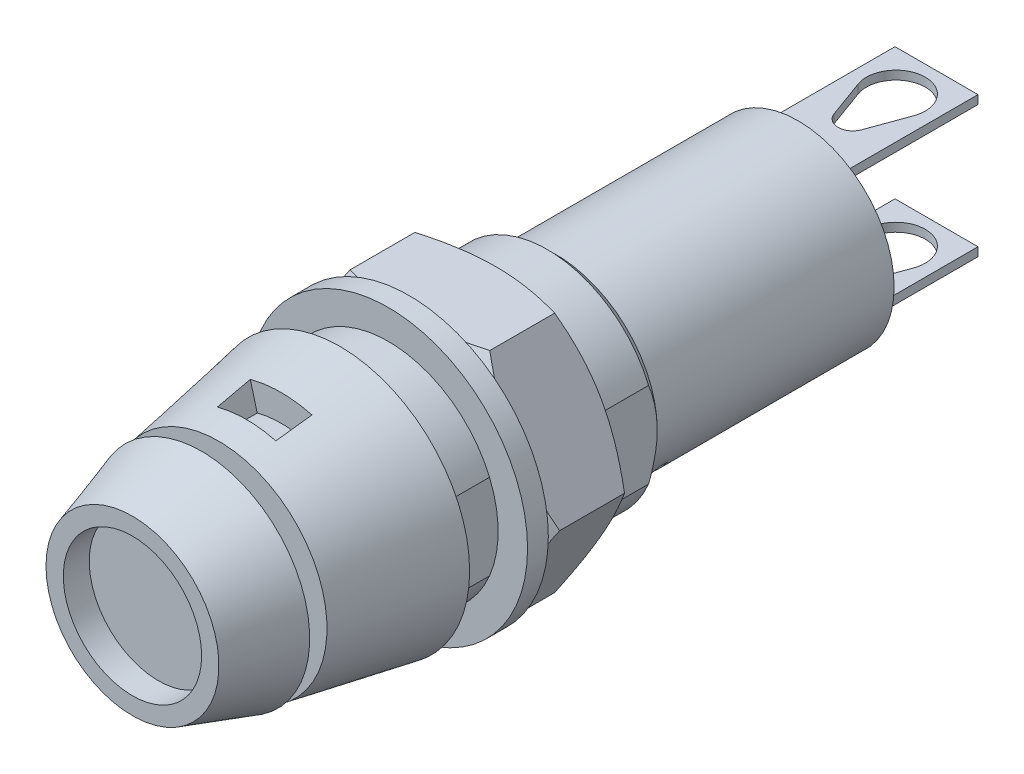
ISO-10303-21;
HEADER;
FILE_DESCRIPTION(('STEP AP214'),'2;1');
FILE_NAME('part.step','',(''),(''),'','','');
FILE_SCHEMA(('AUTOMOTIVE_DESIGN { 1 0 10303 214 1 1 1 1 }'));
ENDSEC;
DATA;
#1=APPLICATION_CONTEXT('core data for automotive mechanical design processes');
#2=APPLICATION_PROTOCOL_DEFINITION('international standard','automotive_design',2000,#1);
#3=PRODUCT_CONTEXT('',#1,'mechanical');
#4=PRODUCT('Part','Part','',(#3));
#5=PRODUCT_RELATED_PRODUCT_CATEGORY('part','',(#4));
#6=PRODUCT_DEFINITION_FORMATION('','',#4);
#7=PRODUCT_DEFINITION_CONTEXT('part definition',#1,'design');
#8=PRODUCT_DEFINITION('design','',#6,#7);
#9=PRODUCT_DEFINITION_SHAPE('','',#8);
#10=(LENGTH_UNIT() NAMED_UNIT(*) SI_UNIT(.MILLI.,.METRE.));
#11=(NAMED_UNIT(*) PLANE_ANGLE_UNIT() SI_UNIT($,.RADIAN.));
#12=(NAMED_UNIT(*) SI_UNIT($,.STERADIAN.) SOLID_ANGLE_UNIT());
#13=UNCERTAINTY_MEASURE_WITH_UNIT(LENGTH_MEASURE(1.E-05),#10,'distance_accuracy_value','');
#14=(GEOMETRIC_REPRESENTATION_CONTEXT(3) GLOBAL_UNCERTAINTY_ASSIGNED_CONTEXT((#13)) GLOBAL_UNIT_ASSIGNED_CONTEXT((#10,
#11,#12)) REPRESENTATION_CONTEXT('',''));
#15=CARTESIAN_POINT('',(0.,0.,0.));
#16=DIRECTION('',(0.,0.,1.));
#17=DIRECTION('',(1.,0.,0.));
#18=AXIS2_PLACEMENT_3D('',#15,#16,#17);
#19=CARTESIAN_POINT('',(0.,0.,10.5));
#20=DIRECTION('',(0.,0.,1.));
#21=DIRECTION('',(1.,0.,0.));
#22=AXIS2_PLACEMENT_3D('',#19,#20,#21);
#23=PLANE('',#22);
#24=CARTESIAN_POINT('',(0.,0.,10.5));
#25=DIRECTION('',(0.,0.,1.));
#26=DIRECTION('',(1.,0.,0.));
#27=AXIS2_PLACEMENT_3D('',#24,#25,#26);
#28=CIRCLE('',#27,4.);
#29=CARTESIAN_POINT('',(4.,0.,10.5));
#30=VERTEX_POINT('',#29);
#31=EDGE_CURVE('E19',#30,#30,#28,.T.);
#32=ORIENTED_EDGE('',*,*,#31,.T.);
#33=EDGE_LOOP('',(#32));
#34=FACE_BOUND('',#33,.T.);
#35=ADVANCED_FACE('F16',(#34),#23,.T.);
#36=CARTESIAN_POINT('',(0.,0.,12.));
#37=DIRECTION('',(0.,0.,1.));
#38=DIRECTION('',(1.,0.,0.));
#39=AXIS2_PLACEMENT_3D('',#36,#37,#38);
#40=CYLINDRICAL_SURFACE('',#39,4.);
#41=ORIENTED_EDGE('',*,*,#31,.F.);
#42=EDGE_LOOP('',(#41));
#43=FACE_BOUND('',#42,.T.);
#44=CARTESIAN_POINT('',(0.,0.,12.));
#45=DIRECTION('',(0.,0.,1.));
#46=DIRECTION('',(1.,0.,0.));
#47=AXIS2_PLACEMENT_3D('',#44,#45,#46);
#48=CIRCLE('',#47,4.);
#49=CARTESIAN_POINT('',(4.,0.,12.));
#50=VERTEX_POINT('',#49);
#51=EDGE_CURVE('E872',#50,#50,#48,.T.);
#52=ORIENTED_EDGE('',*,*,#51,.T.);
#53=EDGE_LOOP('',(#52));
#54=FACE_BOUND('',#53,.T.);
#55=ADVANCED_FACE('F880',(#43,#54),#40,.F.);
#56=CARTESIAN_POINT('',(0.,0.,12.));
#57=DIRECTION('',(0.,0.,-1.));
#58=DIRECTION('',(-1.,0.,0.));
#59=AXIS2_PLACEMENT_3D('',#56,#57,#58);
#60=PLANE('',#59);
#61=ORIENTED_EDGE('',*,*,#51,.F.);
#62=EDGE_LOOP('',(#61));
#63=FACE_BOUND('',#62,.T.);
#64=CARTESIAN_POINT('',(0.,0.,12.0000000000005));
#65=DIRECTION('',(0.,0.,-1.));
#66=DIRECTION('',(-1.,0.,0.));
#67=AXIS2_PLACEMENT_3D('',#64,#65,#66);
#68=CIRCLE('',#67,4.99999999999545);
#69=CARTESIAN_POINT('',(-4.99999999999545,0.,12.0000000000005));
#70=VERTEX_POINT('',#69);
#71=EDGE_CURVE('E870',#70,#70,#68,.F.);
#72=ORIENTED_EDGE('',*,*,#71,.T.);
#73=EDGE_LOOP('',(#72));
#74=FACE_BOUND('',#73,.T.);
#75=ADVANCED_FACE('F882',(#63,#74),#60,.F.);
#76=CARTESIAN_POINT('',(0.,0.,7.99999999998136));
#77=DIRECTION('',(0.,0.,-1.));
#78=DIRECTION('',(-1.,0.,0.));
#79=AXIS2_PLACEMENT_3D('',#76,#77,#78);
#80=CONICAL_SURFACE('',#79,6.25000000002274,0.302884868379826);
#81=ORIENTED_EDGE('',*,*,#71,.F.);
#82=EDGE_LOOP('',(#81));
#83=FACE_BOUND('',#82,.T.);
#84=CARTESIAN_POINT('',(0.,0.,7.99999999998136));
#85=DIRECTION('',(0.,0.,-1.));
#86=DIRECTION('',(-1.,0.,0.));
#87=AXIS2_PLACEMENT_3D('',#84,#85,#86);
#88=CIRCLE('',#87,6.25000000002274);
#89=CARTESIAN_POINT('',(-6.25000000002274,0.,7.99999999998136));
#90=VERTEX_POINT('',#89);
#91=EDGE_CURVE('E328',#90,#90,#88,.F.);
#92=ORIENTED_EDGE('',*,*,#91,.T.);
#93=EDGE_LOOP('',(#92));
#94=FACE_BOUND('',#93,.T.);
#95=ADVANCED_FACE('F887',(#83,#94),#80,.T.);
#96=CARTESIAN_POINT('',(0.,0.,8.));
#97=DIRECTION('',(0.,0.,-1.));
#98=DIRECTION('',(-1.,0.,0.));
#99=AXIS2_PLACEMENT_3D('',#96,#97,#98);
#100=PLANE('',#99);
#101=CARTESIAN_POINT('',(0.,0.,8.));
#102=DIRECTION('',(0.,0.,-1.));
#103=DIRECTION('',(-1.,0.,0.));
#104=AXIS2_PLACEMENT_3D('',#101,#102,#103);
#105=CIRCLE('',#104,3.);
#106=CARTESIAN_POINT('',(-3.,0.,8.));
#107=VERTEX_POINT('',#106);
#108=EDGE_CURVE('E861',#107,#107,#105,.F.);
#109=ORIENTED_EDGE('',*,*,#108,.T.);
#110=EDGE_LOOP('',(#109));
#111=FACE_BOUND('',#110,.T.);
#112=ORIENTED_EDGE('',*,*,#91,.F.);
#113=EDGE_LOOP('',(#112));
#114=FACE_BOUND('',#113,.T.);
#115=ADVANCED_FACE('F893',(#111,#114),#100,.T.);
#116=CARTESIAN_POINT('',(0.,0.,5.4));
#117=DIRECTION('',(0.,0.,1.));
#118=DIRECTION('',(1.,0.,0.));
#119=AXIS2_PLACEMENT_3D('',#116,#117,#118);
#120=PLANE('',#119);
#121=CARTESIAN_POINT('',(0.,0.,5.4));
#122=DIRECTION('',(0.,0.,1.));
#123=DIRECTION('',(1.,0.,0.));
#124=AXIS2_PLACEMENT_3D('',#121,#122,#123);
#125=CIRCLE('',#124,5.35);
#126=CARTESIAN_POINT('',(1.38468189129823,5.16770317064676,5.4));
#127=VERTEX_POINT('',#126);
#128=CARTESIAN_POINT('',(-1.38468189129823,5.16770317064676,5.4));
#129=VERTEX_POINT('',#128);
#130=EDGE_CURVE('E857',#127,#129,#125,.T.);
#131=ORIENTED_EDGE('',*,*,#130,.T.);
#132=DIRECTION('',(0.258819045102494,-0.965925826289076,0.));
#133=VECTOR('',#132,1.);
#134=CARTESIAN_POINT('',(-1.691567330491,6.313015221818,5.4));
#135=LINE('',#134,#133);
#136=CARTESIAN_POINT('',(-1.69156733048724,6.31301522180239,5.40000000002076));
#137=VERTEX_POINT('',#136);
#138=EDGE_CURVE('E327',#137,#129,#135,.T.);
#139=ORIENTED_EDGE('',*,*,#138,.F.);
#140=CARTESIAN_POINT('',(0.,0.,5.40000000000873));
#141=DIRECTION('',(0.,0.,-1.));
#142=DIRECTION('',(-1.,0.,0.));
#143=AXIS2_PLACEMENT_3D('',#140,#141,#142);
#144=CIRCLE('',#143,6.5357142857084);
#145=CARTESIAN_POINT('',(1.6915673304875,6.3130152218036,5.40000000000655));
#146=VERTEX_POINT('',#145);
#147=EDGE_CURVE('E318',#146,#137,#144,.F.);
#148=ORIENTED_EDGE('',*,*,#147,.F.);
#149=DIRECTION('',(0.258819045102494,0.965925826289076,0.));
#150=VECTOR('',#149,1.);
#151=CARTESIAN_POINT('',(1.38468189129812,5.16770317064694,5.4));
#152=LINE('',#151,#150);
#153=EDGE_CURVE('E325',#127,#146,#152,.T.);
#154=ORIENTED_EDGE('',*,*,#153,.F.);
#155=EDGE_LOOP('',(#131,#139,#148,#154));
#156=FACE_BOUND('',#155,.T.);
#157=ADVANCED_FACE('F324',(#156),#120,.F.);
#158=CARTESIAN_POINT('',(0.,0.,5.4));
#159=DIRECTION('',(0.,0.,-1.));
#160=DIRECTION('',(-1.,0.,0.));
#161=AXIS2_PLACEMENT_3D('',#158,#159,#160);
#162=PLANE('',#161);
#163=DIRECTION('',(-0.258819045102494,-0.965925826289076,0.));
#164=VECTOR('',#163,1.);
#165=CARTESIAN_POINT('',(-1.38468189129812,-5.16770317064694,5.4));
#166=LINE('',#165,#164);
#167=CARTESIAN_POINT('',(-1.38468189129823,-5.16770317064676,5.4));
#168=VERTEX_POINT('',#167);
#169=CARTESIAN_POINT('',(-1.69156733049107,-6.31301522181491,5.40000000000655));
#170=VERTEX_POINT('',#169);
#171=EDGE_CURVE('E398',#168,#170,#166,.T.);
#172=ORIENTED_EDGE('',*,*,#171,.F.);
#173=CARTESIAN_POINT('',(0.,0.,5.4));
#174=DIRECTION('',(0.,0.,-1.));
#175=DIRECTION('',(-1.,0.,0.));
#176=AXIS2_PLACEMENT_3D('',#173,#174,#175);
#177=CIRCLE('',#176,5.35);
#178=CARTESIAN_POINT('',(1.38468189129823,-5.16770317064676,5.4));
#179=VERTEX_POINT('',#178);
#180=EDGE_CURVE('E853',#168,#179,#177,.F.);
#181=ORIENTED_EDGE('',*,*,#180,.T.);
#182=DIRECTION('',(-0.258819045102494,0.965925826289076,0.));
#183=VECTOR('',#182,1.);
#184=CARTESIAN_POINT('',(1.691567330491,-6.313015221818,5.4));
#185=LINE('',#184,#183);
#186=CARTESIAN_POINT('',(1.69156733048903,-6.31301522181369,5.40000000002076));
#187=VERTEX_POINT('',#186);
#188=EDGE_CURVE('E337',#187,#179,#185,.T.);
#189=ORIENTED_EDGE('',*,*,#188,.F.);
#190=CARTESIAN_POINT('',(0.,0.,5.40000000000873));
#191=DIRECTION('',(0.,0.,-1.));
#192=DIRECTION('',(-1.,0.,0.));
#193=AXIS2_PLACEMENT_3D('',#190,#191,#192);
#194=CIRCLE('',#193,6.5357142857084);
#195=EDGE_CURVE('E400',#170,#187,#194,.F.);
#196=ORIENTED_EDGE('',*,*,#195,.F.);
#197=EDGE_LOOP('',(#172,#181,#189,#196));
#198=FACE_BOUND('',#197,.T.);
#199=ADVANCED_FACE('F900',(#198),#162,.T.);
#200=CARTESIAN_POINT('',(0.,0.,-4.62896607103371));
#201=DIRECTION('',(0.,0.,-1.));
#202=DIRECTION('',(-1.,0.,0.));
#203=AXIS2_PLACEMENT_3D('',#200,#201,#202);
#204=CONICAL_SURFACE('',#203,8.08940119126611,1.0471975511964);
#205=CARTESIAN_POINT('',(0.,0.,-4.00000000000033));
#206=DIRECTION('',(0.,0.,-1.));
#207=DIRECTION('',(-1.,0.,0.));
#208=AXIS2_PLACEMENT_3D('',#205,#206,#207);
#209=CIRCLE('',#208,6.99999999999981);
#210=CARTESIAN_POINT('',(-6.06217782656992,3.49999999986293,-4.00000000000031));
#211=VERTEX_POINT('',#210);
#212=CARTESIAN_POINT('',(-1.93287019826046E-12,6.99999999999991,-4.00000000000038));
#213=VERTEX_POINT('',#212);
#214=EDGE_CURVE('E764',#211,#213,#209,.T.);
#215=ORIENTED_EDGE('',*,*,#214,.T.);
#216=CARTESIAN_POINT('',(-3.86531178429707E-12,7.,-4.00000000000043));
#217=CARTESIAN_POINT('',(-0.171536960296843,7.,-3.99997139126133));
#218=CARTESIAN_POINT('',(-0.343065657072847,7.,-4.00363970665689));
#219=CARTESIAN_POINT('',(-0.685786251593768,7.,-4.0181575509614));
#220=CARTESIAN_POINT('',(-0.85697820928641,7.,-4.02900565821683));
#221=CARTESIAN_POINT('',(-1.19791956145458,7.,-4.05759901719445));
#222=CARTESIAN_POINT('',(-1.3676718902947,7.,-4.07530954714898));
#223=CARTESIAN_POINT('',(-1.70636778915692,7.,-4.11724679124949));
#224=CARTESIAN_POINT('',(-1.87531133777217,7.,-4.1414736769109));
#225=CARTESIAN_POINT('',(-2.38022852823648,7.,-4.22318043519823));
#226=CARTESIAN_POINT('',(-2.7147353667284,7.,-4.28972608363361));
#227=CARTESIAN_POINT('',(-3.38087243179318,7.,-4.44319736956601));
#228=CARTESIAN_POINT('',(-3.7124794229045,7.,-4.53022478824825));
#229=CARTESIAN_POINT('',(-4.04145188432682,7.,-4.62521478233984));
#230=B_SPLINE_CURVE_WITH_KNOTS('',3,(#216,#217,#218,#219,#220,#221,#222,#223,#224,#225,#226,
#227,#228,#229),.UNSPECIFIED.,.F.,.F.,(4,2,2,2,2,2,4),(0.,0.514558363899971,1.02901487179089,
1.54090167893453,2.05280196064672,3.07526084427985,4.10291216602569),.UNSPECIFIED.);
#231=CARTESIAN_POINT('',(-4.04145188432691,7.,-4.62521478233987));
#232=VERTEX_POINT('',#231);
#233=EDGE_CURVE('E388',#213,#232,#230,.T.);
#234=ORIENTED_EDGE('',*,*,#233,.T.);
#235=CARTESIAN_POINT('',(-4.04145188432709,6.99999999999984,-4.62521478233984));
#236=CARTESIAN_POINT('',(-4.20593811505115,6.71510149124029,-4.53022478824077));
#237=CARTESIAN_POINT('',(-4.37174161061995,6.42792141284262,-4.44319736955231));
#238=CARTESIAN_POINT('',(-4.70481014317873,5.85102979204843,-4.28972608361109));
#239=CARTESIAN_POINT('',(-4.87206356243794,5.56133837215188,-4.22318043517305));
#240=CARTESIAN_POINT('',(-5.12452215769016,5.12406725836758,-4.14147367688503));
#241=CARTESIAN_POINT('',(-5.20899393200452,4.97775785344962,-4.11724679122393));
#242=CARTESIAN_POINT('',(-5.37834188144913,4.68443860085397,-4.07530954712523));
#243=CARTESIAN_POINT('',(-5.46321804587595,4.53742877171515,-4.0575990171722));
#244=CARTESIAN_POINT('',(-5.63368872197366,4.24216489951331,-4.02900565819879));
#245=CARTESIAN_POINT('',(-5.71928470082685,4.09390831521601,-4.01815755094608));
#246=CARTESIAN_POINT('',(-5.89064499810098,3.79710357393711,-4.00363970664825));
#247=CARTESIAN_POINT('',(-5.9764093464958,3.64855536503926,-3.99997139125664));
#248=CARTESIAN_POINT('',(-6.06217782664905,3.49999999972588,-4.00000000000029));
#249=B_SPLINE_CURVE_WITH_KNOTS('',3,(#235,#236,#237,#238,#239,#240,#241,#242,#243,#244,#245,
#246,#247,#248),.UNSPECIFIED.,.F.,.F.,(4,2,2,2,2,2,4),(0.,1.02765132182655,2.05011020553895,
2.56201048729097,3.07389729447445,3.58835380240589,4.10291216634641),.UNSPECIFIED.);
#250=EDGE_CURVE('E387',#232,#211,#249,.T.);
#251=ORIENTED_EDGE('',*,*,#250,.T.);
#252=EDGE_LOOP('',(#215,#234,#251));
#253=FACE_BOUND('',#252,.T.);
#254=ADVANCED_FACE('F902',(#253),#204,.T.);
#255=CARTESIAN_POINT('',(0.,0.,-4.6289660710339));
#256=DIRECTION('',(0.,0.,-1.));
#257=DIRECTION('',(-1.,0.,0.));
#258=AXIS2_PLACEMENT_3D('',#255,#256,#257);
#259=CONICAL_SURFACE('',#258,8.08940119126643,1.0471975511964);
#260=CARTESIAN_POINT('',(-6.06217782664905,3.49999999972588,-4.00000000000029));
#261=CARTESIAN_POINT('',(-6.14794630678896,3.35144463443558,-3.99997139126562));
#262=CARTESIAN_POINT('',(-6.23371065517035,3.202896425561,-4.00363970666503));
#263=CARTESIAN_POINT('',(-6.40507095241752,2.90609168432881,-4.01815755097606));
#264=CARTESIAN_POINT('',(-6.49066693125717,2.75783510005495,-4.02900565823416));
#265=CARTESIAN_POINT('',(-6.66113760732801,2.46257122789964,-4.05759901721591));
#266=CARTESIAN_POINT('',(-6.7460137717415,2.31556139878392,-4.07530954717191));
#267=CARTESIAN_POINT('',(-6.91536172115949,2.02224214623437,-4.11724679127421));
#268=CARTESIAN_POINT('',(-6.99983349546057,1.87593274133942,-4.14147367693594));
#269=CARTESIAN_POINT('',(-7.25229209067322,1.43866162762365,-4.22318043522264));
#270=CARTESIAN_POINT('',(-7.41954550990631,1.14897020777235,-4.28972608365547));
#271=CARTESIAN_POINT('',(-7.75261404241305,0.572078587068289,-4.44319736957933));
#272=CARTESIAN_POINT('',(-7.91841753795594,0.284898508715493,-4.53022478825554));
#273=CARTESIAN_POINT('',(-8.08290376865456,0.,-4.62521478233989));
#274=B_SPLINE_CURVE_WITH_KNOTS('',3,(#260,#261,#262,#263,#264,#265,#266,#267,#268,#269,#270,
#271,#272,#273),.UNSPECIFIED.,.F.,.F.,(4,2,2,2,2,2,4),(0.,0.514558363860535,1.02901487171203,
1.54090167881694,2.0528019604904,3.07526084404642,4.10291216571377),.UNSPECIFIED.);
#275=CARTESIAN_POINT('',(-8.08290376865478,0.,-4.62521478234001));
#276=VERTEX_POINT('',#275);
#277=EDGE_CURVE('E383',#211,#276,#274,.T.);
#278=ORIENTED_EDGE('',*,*,#277,.T.);
#279=CARTESIAN_POINT('',(-8.08290376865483,-2.96491324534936E-13,-4.62521478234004));
#280=CARTESIAN_POINT('',(-7.91841753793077,-0.284898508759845,-4.53022478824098));
#281=CARTESIAN_POINT('',(-7.75261404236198,-0.572078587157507,-4.44319736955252));
#282=CARTESIAN_POINT('',(-7.4195455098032,-1.14897020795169,-4.28972608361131));
#283=CARTESIAN_POINT('',(-7.252292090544,-1.43866162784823,-4.22318043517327));
#284=CARTESIAN_POINT('',(-6.99983349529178,-1.87593274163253,-4.14147367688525));
#285=CARTESIAN_POINT('',(-6.91536172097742,-2.02224214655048,-4.11724679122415));
#286=CARTESIAN_POINT('',(-6.74601377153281,-2.31556139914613,-4.07530954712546));
#287=CARTESIAN_POINT('',(-6.661137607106,-2.46257122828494,-4.05759901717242));
#288=CARTESIAN_POINT('',(-6.49066693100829,-2.75783510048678,-4.02900565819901));
#289=CARTESIAN_POINT('',(-6.40507095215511,-2.90609168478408,-4.01815755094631));
#290=CARTESIAN_POINT('',(-6.23371065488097,-3.20289642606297,-4.00363970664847));
#291=CARTESIAN_POINT('',(-6.14794630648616,-3.35144463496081,-3.99997139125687));
#292=CARTESIAN_POINT('',(-6.06217782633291,-3.5000000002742,-4.00000000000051));
#293=B_SPLINE_CURVE_WITH_KNOTS('',3,(#279,#280,#281,#282,#283,#284,#285,#286,#287,#288,#289,
#290,#291,#292),.UNSPECIFIED.,.F.,.F.,(4,2,2,2,2,2,4),(0.,1.02765132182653,2.05011020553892,
2.56201048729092,3.07389729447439,3.58835380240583,4.10291216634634),.UNSPECIFIED.);
#294=CARTESIAN_POINT('',(-6.06217782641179,-3.50000000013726,-4.00000000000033));
#295=VERTEX_POINT('',#294);
#296=EDGE_CURVE('E382',#276,#295,#293,.T.);
#297=ORIENTED_EDGE('',*,*,#296,.T.);
#298=CARTESIAN_POINT('',(0.,0.,-4.00000000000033));
#299=DIRECTION('',(0.,0.,-1.));
#300=DIRECTION('',(-1.,0.,0.));
#301=AXIS2_PLACEMENT_3D('',#298,#299,#300);
#302=CIRCLE('',#301,6.99999999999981);
#303=EDGE_CURVE('E1145',#295,#211,#302,.T.);
#304=ORIENTED_EDGE('',*,*,#303,.T.);
#305=EDGE_LOOP('',(#278,#297,#304));
#306=FACE_BOUND('',#305,.T.);
#307=ADVANCED_FACE('F906',(#306),#259,.T.);
#308=CARTESIAN_POINT('',(0.,0.,-4.62896607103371));
#309=DIRECTION('',(0.,0.,-1.));
#310=DIRECTION('',(-1.,0.,0.));
#311=AXIS2_PLACEMENT_3D('',#308,#309,#310);
#312=CONICAL_SURFACE('',#311,8.08940119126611,1.0471975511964);
#313=CARTESIAN_POINT('',(0.,0.,-4.00000000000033));
#314=DIRECTION('',(0.,0.,-1.));
#315=DIRECTION('',(-1.,0.,0.));
#316=AXIS2_PLACEMENT_3D('',#313,#314,#315);
#317=CIRCLE('',#316,6.99999999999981);
#318=CARTESIAN_POINT('',(1.9938285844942E-12,-6.99999999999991,-4.00000000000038));
#319=VERTEX_POINT('',#318);
#320=EDGE_CURVE('E1151',#319,#295,#317,.T.);
#321=ORIENTED_EDGE('',*,*,#320,.T.);
#322=CARTESIAN_POINT('',(-6.06217782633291,-3.5000000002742,-4.00000000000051));
#323=CARTESIAN_POINT('',(-5.97640934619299,-3.64855536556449,-3.99997139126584));
#324=CARTESIAN_POINT('',(-5.89064499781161,-3.79710357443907,-4.00363970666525));
#325=CARTESIAN_POINT('',(-5.71928470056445,-4.09390831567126,-4.01815755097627));
#326=CARTESIAN_POINT('',(-5.6336887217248,-4.24216489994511,-4.02900565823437));
#327=CARTESIAN_POINT('',(-5.46321804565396,-4.5374287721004,-4.05759901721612));
#328=CARTESIAN_POINT('',(-5.37834188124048,-4.68443860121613,-4.07530954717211));
#329=CARTESIAN_POINT('',(-5.20899393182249,-4.97775785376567,-4.1172467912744));
#330=CARTESIAN_POINT('',(-5.12452215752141,-5.12406725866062,-4.14147367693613));
#331=CARTESIAN_POINT('',(-4.87206356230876,-5.56133837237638,-4.22318043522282));
#332=CARTESIAN_POINT('',(-4.70481014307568,-5.85102979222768,-4.28972608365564));
#333=CARTESIAN_POINT('',(-4.37174161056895,-6.42792141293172,-4.44319736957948));
#334=CARTESIAN_POINT('',(-4.20593811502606,-6.71510149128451,-4.53022478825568));
#335=CARTESIAN_POINT('',(-4.04145188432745,-6.99999999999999,-4.62521478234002));
#336=B_SPLINE_CURVE_WITH_KNOTS('',3,(#322,#323,#324,#325,#326,#327,#328,#329,#330,#331,#332,
#333,#334,#335),.UNSPECIFIED.,.F.,.F.,(4,2,2,2,2,2,4),(0.,0.514558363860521,1.029014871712,
1.5409016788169,2.05280196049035,3.07526084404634,4.10291216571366),.UNSPECIFIED.);
#337=CARTESIAN_POINT('',(-4.04145188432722,-6.99999999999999,-4.62521478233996));
#338=VERTEX_POINT('',#337);
#339=EDGE_CURVE('E378',#295,#338,#336,.T.);
#340=ORIENTED_EDGE('',*,*,#339,.T.);
#341=CARTESIAN_POINT('',(-4.04145188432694,-7.,-4.62521478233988));
#342=CARTESIAN_POINT('',(-3.71247942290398,-7.,-4.53022478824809));
#343=CARTESIAN_POINT('',(-3.38087243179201,-7.,-4.4431973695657));
#344=CARTESIAN_POINT('',(-2.71473536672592,-7.,-4.28972608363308));
#345=CARTESIAN_POINT('',(-2.38022852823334,-7.,-4.22318043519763));
#346=CARTESIAN_POINT('',(-1.87531133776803,-7.,-4.14147367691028));
#347=CARTESIAN_POINT('',(-1.70636778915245,-7.,-4.11724679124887));
#348=CARTESIAN_POINT('',(-1.36767189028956,-7.,-4.07530954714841));
#349=CARTESIAN_POINT('',(-1.1979195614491,-7.,-4.05759901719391));
#350=CARTESIAN_POINT('',(-0.856978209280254,-7.,-4.02900565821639));
#351=CARTESIAN_POINT('',(-0.68578625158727,-7.,-4.01815755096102));
#352=CARTESIAN_POINT('',(-0.343065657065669,-7.,-4.00363970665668));
#353=CARTESIAN_POINT('',(-0.171536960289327,-7.,-3.99997139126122));
#354=CARTESIAN_POINT('',(3.98690799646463E-12,-7.,-4.00000000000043));
#355=B_SPLINE_CURVE_WITH_KNOTS('',3,(#341,#342,#343,#344,#345,#346,#347,#348,#349,#350,#351,
#352,#353,#354),.UNSPECIFIED.,.F.,.F.,(4,2,2,2,2,2,4),(0.,1.02765132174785,2.05011020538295,
2.56201048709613,3.07389729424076,3.58835380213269,4.10291216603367),.UNSPECIFIED.);
#356=EDGE_CURVE('E377',#338,#319,#355,.T.);
#357=ORIENTED_EDGE('',*,*,#356,.T.);
#358=EDGE_LOOP('',(#321,#340,#357));
#359=FACE_BOUND('',#358,.T.);
#360=ADVANCED_FACE('F1183',(#359),#312,.T.);
#361=CARTESIAN_POINT('',(0.,0.,-4.62896607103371));
#362=DIRECTION('',(0.,0.,-1.));
#363=DIRECTION('',(-1.,0.,0.));
#364=AXIS2_PLACEMENT_3D('',#361,#362,#363);
#365=CONICAL_SURFACE('',#364,8.08940119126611,1.0471975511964);
#366=CARTESIAN_POINT('',(0.,0.,-4.00000000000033));
#367=DIRECTION('',(0.,0.,-1.));
#368=DIRECTION('',(-1.,0.,0.));
#369=AXIS2_PLACEMENT_3D('',#366,#367,#368);
#370=CIRCLE('',#369,6.99999999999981);
#371=CARTESIAN_POINT('',(6.06217782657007,-3.49999999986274,-4.00000000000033));
#372=VERTEX_POINT('',#371);
#373=EDGE_CURVE('E1153',#372,#319,#370,.T.);
#374=ORIENTED_EDGE('',*,*,#373,.T.);
#375=CARTESIAN_POINT('',(3.98637133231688E-12,-7.,-4.00000000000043));
#376=CARTESIAN_POINT('',(0.171536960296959,-7.,-3.99997139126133));
#377=CARTESIAN_POINT('',(0.343065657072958,-7.,-4.00363970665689));
#378=CARTESIAN_POINT('',(0.685786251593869,-7.,-4.0181575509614));
#379=CARTESIAN_POINT('',(0.856978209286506,-7.,-4.02900565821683));
#380=CARTESIAN_POINT('',(1.19791956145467,-7.,-4.05759901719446));
#381=CARTESIAN_POINT('',(1.36767189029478,-7.,-4.07530954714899));
#382=CARTESIAN_POINT('',(1.70636778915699,-7.,-4.1172467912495));
#383=CARTESIAN_POINT('',(1.87531133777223,-7.,-4.14147367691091));
#384=CARTESIAN_POINT('',(2.38022852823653,-7.,-4.22318043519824));
#385=CARTESIAN_POINT('',(2.71473536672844,-7.,-4.28972608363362));
#386=CARTESIAN_POINT('',(3.3808724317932,-7.,-4.44319736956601));
#387=CARTESIAN_POINT('',(3.71247942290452,-7.,-4.53022478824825));
#388=CARTESIAN_POINT('',(4.04145188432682,-7.,-4.62521478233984));
#389=B_SPLINE_CURVE_WITH_KNOTS('',3,(#375,#376,#377,#378,#379,#380,#381,#382,#383,#384,#385,
#386,#387,#388),.UNSPECIFIED.,.F.,.F.,(4,2,2,2,2,2,4),(0.,0.514558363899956,1.02901487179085,
1.54090167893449,2.05280196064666,3.07526084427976,4.10291216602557),.UNSPECIFIED.);
#390=CARTESIAN_POINT('',(4.04145188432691,-7.,-4.62521478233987));
#391=VERTEX_POINT('',#390);
#392=EDGE_CURVE('E373',#319,#391,#389,.T.);
#393=ORIENTED_EDGE('',*,*,#392,.T.);
#394=CARTESIAN_POINT('',(4.04145188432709,-6.99999999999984,-4.62521478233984));
#395=CARTESIAN_POINT('',(4.20593811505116,-6.71510149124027,-4.53022478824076));
#396=CARTESIAN_POINT('',(4.37174161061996,-6.42792141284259,-4.4431973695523));
#397=CARTESIAN_POINT('',(4.70481014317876,-5.85102979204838,-4.28972608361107));
#398=CARTESIAN_POINT('',(4.87206356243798,-5.56133837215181,-4.22318043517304));
#399=CARTESIAN_POINT('',(5.12452215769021,-5.12406725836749,-4.14147367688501));
#400=CARTESIAN_POINT('',(5.20899393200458,-4.97775785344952,-4.11724679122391));
#401=CARTESIAN_POINT('',(5.37834188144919,-4.68443860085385,-4.07530954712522));
#402=CARTESIAN_POINT('',(5.46321804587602,-4.53742877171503,-4.05759901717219));
#403=CARTESIAN_POINT('',(5.63368872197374,-4.24216489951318,-4.02900565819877));
#404=CARTESIAN_POINT('',(5.71928470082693,-4.09390831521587,-4.01815755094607));
#405=CARTESIAN_POINT('',(5.89064499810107,-3.79710357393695,-4.00363970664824));
#406=CARTESIAN_POINT('',(5.97640934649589,-3.6485553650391,-3.99997139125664));
#407=CARTESIAN_POINT('',(6.06217782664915,-3.4999999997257,-4.00000000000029));
#408=B_SPLINE_CURVE_WITH_KNOTS('',3,(#394,#395,#396,#397,#398,#399,#400,#401,#402,#403,#404,
#405,#406,#407),.UNSPECIFIED.,.F.,.F.,(4,2,2,2,2,2,4),(0.,1.0276513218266,2.05011020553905,
2.56201048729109,3.0738972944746,3.58835380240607,4.10291216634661),.UNSPECIFIED.);
#409=EDGE_CURVE('E372',#391,#372,#408,.T.);
#410=ORIENTED_EDGE('',*,*,#409,.T.);
#411=EDGE_LOOP('',(#374,#393,#410));
#412=FACE_BOUND('',#411,.T.);
#413=ADVANCED_FACE('F1167',(#412),#365,.T.);
#414=CARTESIAN_POINT('',(0.,0.,-4.6289660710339));
#415=DIRECTION('',(0.,0.,-1.));
#416=DIRECTION('',(-1.,0.,0.));
#417=AXIS2_PLACEMENT_3D('',#414,#415,#416);
#418=CONICAL_SURFACE('',#417,8.08940119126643,1.0471975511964);
#419=CARTESIAN_POINT('',(0.,0.,-4.00000000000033));
#420=DIRECTION('',(0.,0.,-1.));
#421=DIRECTION('',(-1.,0.,0.));
#422=AXIS2_PLACEMENT_3D('',#419,#420,#421);
#423=CIRCLE('',#422,6.99999999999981);
#424=CARTESIAN_POINT('',(6.06217782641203,3.50000000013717,-4.00000000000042));
#425=VERTEX_POINT('',#424);
#426=EDGE_CURVE('E859',#425,#372,#423,.T.);
#427=ORIENTED_EDGE('',*,*,#426,.T.);
#428=CARTESIAN_POINT('',(6.06217782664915,-3.4999999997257,-4.00000000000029));
#429=CARTESIAN_POINT('',(6.14794630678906,-3.35144463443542,-3.99997139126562));
#430=CARTESIAN_POINT('',(6.23371065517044,-3.20289642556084,-4.00363970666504));
#431=CARTESIAN_POINT('',(6.4050709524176,-2.90609168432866,-4.01815755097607));
#432=CARTESIAN_POINT('',(6.49066693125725,-2.75783510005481,-4.02900565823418));
#433=CARTESIAN_POINT('',(6.66113760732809,-2.46257122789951,-4.05759901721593));
#434=CARTESIAN_POINT('',(6.74601377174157,-2.3155613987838,-4.07530954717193));
#435=CARTESIAN_POINT('',(6.91536172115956,-2.02224214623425,-4.11724679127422));
#436=CARTESIAN_POINT('',(6.99983349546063,-1.87593274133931,-4.14147367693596));
#437=CARTESIAN_POINT('',(7.25229209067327,-1.43866162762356,-4.22318043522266));
#438=CARTESIAN_POINT('',(7.41954550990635,-1.14897020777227,-4.28972608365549));
#439=CARTESIAN_POINT('',(7.75261404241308,-0.572078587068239,-4.44319736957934));
#440=CARTESIAN_POINT('',(7.91841753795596,-0.284898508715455,-4.53022478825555));
#441=CARTESIAN_POINT('',(8.08290376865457,0.,-4.6252147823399));
#442=B_SPLINE_CURVE_WITH_KNOTS('',3,(#428,#429,#430,#431,#432,#433,#434,#435,#436,#437,#438,
#439,#440,#441),.UNSPECIFIED.,.F.,.F.,(4,2,2,2,2,2,4),(0.,0.514558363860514,1.02901487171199,
1.54090167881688,2.05280196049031,3.07526084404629,4.1029121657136),.UNSPECIFIED.);
#443=CARTESIAN_POINT('',(8.08290376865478,0.,-4.62521478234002));
#444=VERTEX_POINT('',#443);
#445=EDGE_CURVE('E368',#372,#444,#442,.T.);
#446=ORIENTED_EDGE('',*,*,#445,.T.);
#447=CARTESIAN_POINT('',(8.08290376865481,3.22832164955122E-13,-4.62521478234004));
#448=CARTESIAN_POINT('',(7.91841753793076,0.284898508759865,-4.53022478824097));
#449=CARTESIAN_POINT('',(7.75261404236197,0.57207858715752,-4.44319736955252));
#450=CARTESIAN_POINT('',(7.4195455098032,1.14897020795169,-4.28972608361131));
#451=CARTESIAN_POINT('',(7.252292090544,1.43866162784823,-4.22318043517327));
#452=CARTESIAN_POINT('',(6.99983349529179,1.87593274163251,-4.14147367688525));
#453=CARTESIAN_POINT('',(6.91536172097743,2.02224214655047,-4.11724679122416));
#454=CARTESIAN_POINT('',(6.74601377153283,2.31556139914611,-4.07530954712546));
#455=CARTESIAN_POINT('',(6.66113760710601,2.46257122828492,-4.05759901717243));
#456=CARTESIAN_POINT('',(6.49066693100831,2.75783510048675,-4.02900565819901));
#457=CARTESIAN_POINT('',(6.40507095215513,2.90609168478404,-4.01815755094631));
#458=CARTESIAN_POINT('',(6.233710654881,3.20289642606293,-4.00363970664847));
#459=CARTESIAN_POINT('',(6.14794630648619,3.35144463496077,-3.99997139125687));
#460=CARTESIAN_POINT('',(6.06217782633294,3.50000000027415,-4.00000000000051));
#461=B_SPLINE_CURVE_WITH_KNOTS('',3,(#447,#448,#449,#450,#451,#452,#453,#454,#455,#456,#457,
#458,#459,#460),.UNSPECIFIED.,.F.,.F.,(4,2,2,2,2,2,4),(0.,1.02765132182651,2.05011020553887,
2.56201048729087,3.07389729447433,3.58835380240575,4.10291216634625),.UNSPECIFIED.);
#462=EDGE_CURVE('E367',#444,#425,#461,.T.);
#463=ORIENTED_EDGE('',*,*,#462,.T.);
#464=EDGE_LOOP('',(#427,#446,#463));
#465=FACE_BOUND('',#464,.T.);
#466=ADVANCED_FACE('F749',(#465),#418,.T.);
#467=CARTESIAN_POINT('',(0.,0.,-4.62896607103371));
#468=DIRECTION('',(0.,0.,-1.));
#469=DIRECTION('',(-1.,0.,0.));
#470=AXIS2_PLACEMENT_3D('',#467,#468,#469);
#471=CONICAL_SURFACE('',#470,8.08940119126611,1.0471975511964);
#472=CARTESIAN_POINT('',(0.,0.,-4.00000000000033));
#473=DIRECTION('',(0.,0.,-1.));
#474=DIRECTION('',(-1.,0.,0.));
#475=AXIS2_PLACEMENT_3D('',#472,#473,#474);
#476=CIRCLE('',#475,6.99999999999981);
#477=EDGE_CURVE('E856',#213,#425,#476,.T.);
#478=ORIENTED_EDGE('',*,*,#477,.T.);
#479=CARTESIAN_POINT('',(6.06217782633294,3.50000000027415,-4.00000000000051));
#480=CARTESIAN_POINT('',(5.97640934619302,3.64855536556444,-3.99997139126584));
#481=CARTESIAN_POINT('',(5.89064499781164,3.79710357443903,-4.00363970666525));
#482=CARTESIAN_POINT('',(5.71928470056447,4.09390831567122,-4.01815755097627));
#483=CARTESIAN_POINT('',(5.63368872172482,4.24216489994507,-4.02900565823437));
#484=CARTESIAN_POINT('',(5.46321804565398,4.53742877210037,-4.05759901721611));
#485=CARTESIAN_POINT('',(5.37834188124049,4.68443860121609,-4.0753095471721));
#486=CARTESIAN_POINT('',(5.2089939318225,4.97775785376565,-4.11724679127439));
#487=CARTESIAN_POINT('',(5.12452215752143,5.12406725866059,-4.14147367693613));
#488=CARTESIAN_POINT('',(4.87206356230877,5.56133837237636,-4.22318043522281));
#489=CARTESIAN_POINT('',(4.70481014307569,5.85102979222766,-4.28972608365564));
#490=CARTESIAN_POINT('',(4.37174161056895,6.42792141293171,-4.44319736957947));
#491=CARTESIAN_POINT('',(4.20593811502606,6.7151014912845,-4.53022478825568));
#492=CARTESIAN_POINT('',(4.04145188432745,6.99999999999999,-4.62521478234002));
#493=B_SPLINE_CURVE_WITH_KNOTS('',3,(#479,#480,#481,#482,#483,#484,#485,#486,#487,#488,#489,
#490,#491,#492),.UNSPECIFIED.,.F.,.F.,(4,2,2,2,2,2,4),(0.,0.514558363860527,1.02901487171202,
1.54090167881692,2.05280196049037,3.07526084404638,4.10291216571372),.UNSPECIFIED.);
#494=CARTESIAN_POINT('',(4.04145188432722,6.99999999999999,-4.62521478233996));
#495=VERTEX_POINT('',#494);
#496=EDGE_CURVE('E363',#425,#495,#493,.T.);
#497=ORIENTED_EDGE('',*,*,#496,.T.);
#498=CARTESIAN_POINT('',(4.041451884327,7.,-4.62521478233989));
#499=CARTESIAN_POINT('',(3.71247942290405,7.,-4.53022478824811));
#500=CARTESIAN_POINT('',(3.38087243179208,7.,-4.44319736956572));
#501=CARTESIAN_POINT('',(2.714735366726,7.,-4.2897260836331));
#502=CARTESIAN_POINT('',(2.38022852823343,7.,-4.22318043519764));
#503=CARTESIAN_POINT('',(1.87531133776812,7.,-4.14147367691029));
#504=CARTESIAN_POINT('',(1.70636778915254,7.,-4.11724679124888));
#505=CARTESIAN_POINT('',(1.36767189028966,7.,-4.07530954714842));
#506=CARTESIAN_POINT('',(1.1979195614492,7.,-4.05759901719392));
#507=CARTESIAN_POINT('',(0.856978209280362,7.,-4.0290056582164));
#508=CARTESIAN_POINT('',(0.685786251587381,7.,-4.01815755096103));
#509=CARTESIAN_POINT('',(0.343065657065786,7.,-4.00363970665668));
#510=CARTESIAN_POINT('',(0.171536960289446,7.,-3.99997139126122));
#511=CARTESIAN_POINT('',(-3.86553368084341E-12,7.,-4.00000000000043));
#512=B_SPLINE_CURVE_WITH_KNOTS('',3,(#498,#499,#500,#501,#502,#503,#504,#505,#506,#507,#508,
#509,#510,#511),.UNSPECIFIED.,.F.,.F.,(4,2,2,2,2,2,4),(0.,1.02765132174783,2.05011020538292,
2.56201048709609,3.07389729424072,3.58835380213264,4.10291216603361),.UNSPECIFIED.);
#513=EDGE_CURVE('E756',#495,#213,#512,.T.);
#514=ORIENTED_EDGE('',*,*,#513,.T.);
#515=EDGE_LOOP('',(#478,#497,#514));
#516=FACE_BOUND('',#515,.T.);
#517=ADVANCED_FACE('F744',(#516),#471,.T.);
#518=CARTESIAN_POINT('',(0.,0.,12.25));
#519=DIRECTION('',(0.,0.,-1.));
#520=DIRECTION('',(-1.,0.,0.));
#521=AXIS2_PLACEMENT_3D('',#518,#519,#520);
#522=CYLINDRICAL_SURFACE('',#521,3.);
#523=ORIENTED_EDGE('',*,*,#108,.F.);
#524=EDGE_LOOP('',(#523));
#525=FACE_BOUND('',#524,.T.);
#526=CARTESIAN_POINT('',(0.,0.,7.));
#527=DIRECTION('',(0.,0.,-1.));
#528=DIRECTION('',(-1.,0.,0.));
#529=AXIS2_PLACEMENT_3D('',#526,#527,#528);
#530=CIRCLE('',#529,3.);
#531=CARTESIAN_POINT('',(-3.,0.,7.));
#532=VERTEX_POINT('',#531);
#533=EDGE_CURVE('E392',#532,#532,#530,.F.);
#534=ORIENTED_EDGE('',*,*,#533,.T.);
#535=EDGE_LOOP('',(#534));
#536=FACE_BOUND('',#535,.T.);
#537=ADVANCED_FACE('F748',(#525,#536),#522,.T.);
#538=CARTESIAN_POINT('',(0.,0.,3.3));
#539=DIRECTION('',(0.,0.,1.));
#540=DIRECTION('',(1.,0.,0.));
#541=AXIS2_PLACEMENT_3D('',#538,#539,#540);
#542=CYLINDRICAL_SURFACE('',#541,5.35);
#543=DIRECTION('',(0.,0.,1.));
#544=VECTOR('',#543,1.);
#545=CARTESIAN_POINT('',(-1.38468189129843,5.16770317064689,3.3));
#546=LINE('',#545,#544);
#547=CARTESIAN_POINT('',(-1.38468189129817,5.16770317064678,3.4));
#548=VERTEX_POINT('',#547);
#549=EDGE_CURVE('E393',#548,#129,#546,.T.);
#550=ORIENTED_EDGE('',*,*,#549,.T.);
#551=ORIENTED_EDGE('',*,*,#130,.F.);
#552=DIRECTION('',(0.,0.,1.));
#553=VECTOR('',#552,1.);
#554=CARTESIAN_POINT('',(1.38468189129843,5.16770317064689,3.3));
#555=LINE('',#554,#553);
#556=CARTESIAN_POINT('',(1.38468189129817,5.16770317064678,3.4));
#557=VERTEX_POINT('',#556);
#558=EDGE_CURVE('E336',#127,#557,#555,.F.);
#559=ORIENTED_EDGE('',*,*,#558,.T.);
#560=CARTESIAN_POINT('',(0.,0.,3.4));
#561=DIRECTION('',(0.,0.,1.));
#562=DIRECTION('',(1.,0.,0.));
#563=AXIS2_PLACEMENT_3D('',#560,#561,#562);
#564=CIRCLE('',#563,5.35);
#565=EDGE_CURVE('E717',#557,#548,#564,.T.);
#566=ORIENTED_EDGE('',*,*,#565,.T.);
#567=EDGE_LOOP('',(#550,#551,#559,#566));
#568=FACE_BOUND('',#567,.T.);
#569=ADVANCED_FACE('F1218',(#568),#542,.T.);
#570=CARTESIAN_POINT('',(0.,0.,3.3));
#571=DIRECTION('',(0.,0.,-1.));
#572=DIRECTION('',(-1.,0.,0.));
#573=AXIS2_PLACEMENT_3D('',#570,#571,#572);
#574=CYLINDRICAL_SURFACE('',#573,5.35);
#575=DIRECTION('',(0.,0.,1.));
#576=VECTOR('',#575,1.);
#577=CARTESIAN_POINT('',(-1.38468189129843,-5.16770317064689,3.3));
#578=LINE('',#577,#576);
#579=CARTESIAN_POINT('',(-1.38468189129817,-5.16770317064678,3.4));
#580=VERTEX_POINT('',#579);
#581=EDGE_CURVE('E362',#168,#580,#578,.F.);
#582=ORIENTED_EDGE('',*,*,#581,.T.);
#583=CARTESIAN_POINT('',(0.,0.,3.4));
#584=DIRECTION('',(0.,0.,-1.));
#585=DIRECTION('',(-1.,0.,0.));
#586=AXIS2_PLACEMENT_3D('',#583,#584,#585);
#587=CIRCLE('',#586,5.35);
#588=CARTESIAN_POINT('',(1.38468189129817,-5.16770317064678,3.4));
#589=VERTEX_POINT('',#588);
#590=EDGE_CURVE('E710',#580,#589,#587,.F.);
#591=ORIENTED_EDGE('',*,*,#590,.T.);
#592=DIRECTION('',(0.,0.,1.));
#593=VECTOR('',#592,1.);
#594=CARTESIAN_POINT('',(1.38468189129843,-5.16770317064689,3.3));
#595=LINE('',#594,#593);
#596=EDGE_CURVE('E389',#589,#179,#595,.T.);
#597=ORIENTED_EDGE('',*,*,#596,.T.);
#598=ORIENTED_EDGE('',*,*,#180,.F.);
#599=EDGE_LOOP('',(#582,#591,#597,#598));
#600=FACE_BOUND('',#599,.T.);
#601=ADVANCED_FACE('F850',(#600),#574,.T.);
#602=CARTESIAN_POINT('',(0.,0.,-4.));
#603=DIRECTION('',(0.,0.,-1.));
#604=DIRECTION('',(-1.,0.,0.));
#605=AXIS2_PLACEMENT_3D('',#602,#603,#604);
#606=PLANE('',#605);
#607=ORIENTED_EDGE('',*,*,#303,.F.);
#608=ORIENTED_EDGE('',*,*,#320,.F.);
#609=ORIENTED_EDGE('',*,*,#373,.F.);
#610=ORIENTED_EDGE('',*,*,#426,.F.);
#611=ORIENTED_EDGE('',*,*,#477,.F.);
#612=ORIENTED_EDGE('',*,*,#214,.F.);
#613=EDGE_LOOP('',(#607,#608,#609,#610,#611,#612));
#614=FACE_BOUND('',#613,.T.);
#615=CARTESIAN_POINT('',(0.,0.,-4.));
#616=DIRECTION('',(0.,0.,-1.));
#617=DIRECTION('',(-1.,0.,0.));
#618=AXIS2_PLACEMENT_3D('',#615,#616,#617);
#619=CIRCLE('',#618,8.05);
#620=CARTESIAN_POINT('',(-8.05,0.,-4.));
#621=VERTEX_POINT('',#620);
#622=EDGE_CURVE('E709',#621,#621,#619,.T.);
#623=ORIENTED_EDGE('',*,*,#622,.T.);
#624=EDGE_LOOP('',(#623));
#625=FACE_BOUND('',#624,.T.);
#626=ADVANCED_FACE('F777',(#614,#625),#606,.T.);
#627=CARTESIAN_POINT('',(4.041451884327,7.,-9.));
#628=DIRECTION('',(0.,-1.,0.));
#629=DIRECTION('',(0.,0.,-1.));
#630=AXIS2_PLACEMENT_3D('',#627,#628,#629);
#631=PLANE('',#630);
#632=DIRECTION('',(0.,0.,1.));
#633=VECTOR('',#632,1.);
#634=CARTESIAN_POINT('',(-4.041451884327,7.,-9.));
#635=LINE('',#634,#633);
#636=CARTESIAN_POINT('',(-4.04145190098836,7.,-8.37478521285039));
#637=VERTEX_POINT('',#636);
#638=EDGE_CURVE('E384',#637,#232,#635,.T.);
#639=ORIENTED_EDGE('',*,*,#638,.T.);
#640=ORIENTED_EDGE('',*,*,#233,.F.);
#641=ORIENTED_EDGE('',*,*,#513,.F.);
#642=DIRECTION('',(0.,0.,1.));
#643=VECTOR('',#642,1.);
#644=CARTESIAN_POINT('',(4.04145188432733,7.00000000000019,-9.));
#645=LINE('',#644,#643);
#646=CARTESIAN_POINT('',(4.04145187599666,7.00000001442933,-8.3747852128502));
#647=VERTEX_POINT('',#646);
#648=EDGE_CURVE('E360',#495,#647,#645,.F.);
#649=ORIENTED_EDGE('',*,*,#648,.T.);
#650=CARTESIAN_POINT('',(4.04145179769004,7.,-8.37478524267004));
#651=CARTESIAN_POINT('',(3.71247934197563,7.,-8.46977523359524));
#652=CARTESIAN_POINT('',(3.38087235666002,7.,-8.55680264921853));
#653=CARTESIAN_POINT('',(2.71473530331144,7.,-8.71027392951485));
#654=CARTESIAN_POINT('',(2.38022847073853,7.,-8.77681957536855));
#655=CARTESIAN_POINT('',(1.87531128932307,7.,-8.85852633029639));
#656=CARTESIAN_POINT('',(1.70636774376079,7.,-8.88275321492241));
#657=CARTESIAN_POINT('',(1.36767185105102,7.,-8.92469045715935));
#658=CARTESIAN_POINT('',(1.19791952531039,7.,-8.94240098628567));
#659=CARTESIAN_POINT('',(0.85697817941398,7.,-8.97099434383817));
#660=CARTESIAN_POINT('',(0.685786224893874,7.,-8.98184245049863));
#661=CARTESIAN_POINT('',(0.343065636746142,7.,-8.99636029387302));
#662=CARTESIAN_POINT('',(0.171536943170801,7.,-9.0000286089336));
#663=CARTESIAN_POINT('',(-1.39163493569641E-08,7.,-8.99999999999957));
#664=B_SPLINE_CURVE_WITH_KNOTS('',3,(#650,#651,#652,#653,#654,#655,#656,#657,#658,#659,#660,
#661,#662,#663),.UNSPECIFIED.,.F.,.F.,(4,2,2,2,2,2,4),(0.,1.02765130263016,2.05011016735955,
2.56201043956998,3.0738972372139,3.58835373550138,4.10291208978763),.UNSPECIFIED.);
#665=CARTESIAN_POINT('',(-6.96228340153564E-09,7.00000000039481,-8.99999999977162));
#666=VERTEX_POINT('',#665);
#667=EDGE_CURVE('E793',#647,#666,#664,.T.);
#668=ORIENTED_EDGE('',*,*,#667,.T.);
#669=CARTESIAN_POINT('',(-1.39245672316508E-08,6.99999999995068,-8.9999999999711));
#670=CARTESIAN_POINT('',(-0.171536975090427,6.99999999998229,-9.00002860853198));
#671=CARTESIAN_POINT('',(-0.34306567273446,6.99999999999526,-8.99636029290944));
#672=CARTESIAN_POINT('',(-0.685786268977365,7.00000000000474,-8.98184244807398));
#673=CARTESIAN_POINT('',(-0.856978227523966,7.00000000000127,-8.97099434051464));
#674=CARTESIAN_POINT('',(-1.19791958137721,6.99999999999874,-8.94240098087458));
#675=CARTESIAN_POINT('',(-1.36767191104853,6.99999999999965,-8.92469045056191));
#676=CARTESIAN_POINT('',(-1.70636781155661,7.00000000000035,-8.88275320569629));
#677=CARTESIAN_POINT('',(-1.87531136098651,7.00000000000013,-8.85852631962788));
#678=CARTESIAN_POINT('',(-2.38022855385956,6.99999999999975,-8.7768195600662));
#679=CARTESIAN_POINT('',(-2.71473539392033,6.99999999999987,-8.71027391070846));
#680=CARTESIAN_POINT('',(-3.38087246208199,7.00000000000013,-8.55680262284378));
#681=CARTESIAN_POINT('',(-3.71247945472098,7.00000000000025,-8.46977520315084));
#682=CARTESIAN_POINT('',(-4.04145191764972,7.,-8.37478520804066));
#683=B_SPLINE_CURVE_WITH_KNOTS('',3,(#669,#670,#671,#672,#673,#674,#675,#676,#677,#678,#679,
#680,#681,#682),.UNSPECIFIED.,.F.,.F.,(4,2,2,2,2,2,4),(0.,0.514558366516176,1.02901487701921,
1.54090168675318,2.05280197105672,3.07526085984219,4.10291218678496),.UNSPECIFIED.);
#684=EDGE_CURVE('E785',#666,#637,#683,.T.);
#685=ORIENTED_EDGE('',*,*,#684,.T.);
#686=EDGE_LOOP('',(#639,#640,#641,#649,#668,#685));
#687=FACE_BOUND('',#686,.T.);
#688=ADVANCED_FACE('F771',(#687),#631,.F.);
#689=CARTESIAN_POINT('',(-4.041451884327,7.,-9.));
#690=DIRECTION('',(0.866025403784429,-0.500000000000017,0.));
#691=DIRECTION('',(0.500000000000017,0.866025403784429,0.));
#692=AXIS2_PLACEMENT_3D('',#689,#690,#691);
#693=PLANE('',#692);
#694=ORIENTED_EDGE('',*,*,#277,.F.);
#695=ORIENTED_EDGE('',*,*,#250,.F.);
#696=ORIENTED_EDGE('',*,*,#638,.F.);
#697=CARTESIAN_POINT('',(-4.04145192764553,6.9999999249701,-8.37478524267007));
#698=CARTESIAN_POINT('',(-4.20593815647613,6.71510141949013,-8.46977523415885));
#699=CARTESIAN_POINT('',(-4.37174165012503,6.42792134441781,-8.55680265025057));
#700=CARTESIAN_POINT('',(-4.70481017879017,5.8510297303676,-8.71027393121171));
#701=CARTESIAN_POINT('',(-4.87206359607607,5.56133831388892,-8.77681957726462));
#702=CARTESIAN_POINT('',(-5.12452218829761,5.12406720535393,-8.85852633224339));
#703=CARTESIAN_POINT('',(-5.20899396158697,4.97775780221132,-8.88275321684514));
#704=CARTESIAN_POINT('',(-5.37834190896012,4.68443855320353,-8.92469045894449));
#705=CARTESIAN_POINT('',(-5.46321807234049,4.53742872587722,-8.94240098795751));
#706=CARTESIAN_POINT('',(-5.63368874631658,4.24216485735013,-8.97099434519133));
#707=CARTESIAN_POINT('',(-5.71928472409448,4.09390827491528,-8.98184245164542));
#708=CARTESIAN_POINT('',(-5.89064501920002,3.7971035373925,-8.99636029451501));
#709=CARTESIAN_POINT('',(-5.97640936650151,3.64855533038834,-9.00002860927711));
#710=CARTESIAN_POINT('',(-6.06217784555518,3.49999996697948,-8.99999999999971));
#711=B_SPLINE_CURVE_WITH_KNOTS('',3,(#697,#698,#699,#700,#701,#702,#703,#704,#705,#706,#707,
#708,#709,#710),.UNSPECIFIED.,.F.,.F.,(4,2,2,2,2,2,4),(0.,1.02765130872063,2.05011017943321,
2.56201045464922,3.07389725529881,3.58835375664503,4.10291211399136),.UNSPECIFIED.);
#712=CARTESIAN_POINT('',(-6.06217784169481,3.49999997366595,-8.99999999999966));
#713=VERTEX_POINT('',#712);
#714=EDGE_CURVE('E1133',#637,#713,#711,.T.);
#715=ORIENTED_EDGE('',*,*,#714,.T.);
#716=CARTESIAN_POINT('',(-6.06217784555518,3.49999996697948,-8.99999999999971));
#717=CARTESIAN_POINT('',(-6.14794632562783,3.35144460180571,-9.0000286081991));
#718=CARTESIAN_POINT('',(-6.23371067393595,3.20289639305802,-8.99636029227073));
#719=CARTESIAN_POINT('',(-6.40507097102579,2.90609165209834,-8.98184244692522));
#720=CARTESIAN_POINT('',(-6.49066694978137,2.75783506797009,-8.97099433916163));
#721=CARTESIAN_POINT('',(-6.66113762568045,2.46257119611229,-8.94240097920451));
#722=CARTESIAN_POINT('',(-6.74601379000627,2.3155613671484,-8.92469044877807));
#723=CARTESIAN_POINT('',(-6.91536173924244,2.02224211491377,-8.88275320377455));
#724=CARTESIAN_POINT('',(-6.99983351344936,1.87593271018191,-8.85852631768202));
#725=CARTESIAN_POINT('',(-7.25229210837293,1.43866159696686,-8.77681955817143));
#726=CARTESIAN_POINT('',(-7.41954552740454,1.14897017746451,-8.71027390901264));
#727=CARTESIAN_POINT('',(-7.75261405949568,0.572078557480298,-8.55680262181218));
#728=CARTESIAN_POINT('',(-7.91841755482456,0.28489847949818,-8.46977520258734));
#729=CARTESIAN_POINT('',(-8.08290378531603,-2.88585134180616E-08,-8.3747852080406));
#730=B_SPLINE_CURVE_WITH_KNOTS('',3,(#716,#717,#718,#719,#720,#721,#722,#723,#724,#725,#726,
#727,#728,#729),.UNSPECIFIED.,.F.,.F.,(4,2,2,2,2,2,4),(0.,0.514558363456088,1.02901487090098,
1.54090167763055,2.05280195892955,3.07526084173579,4.10291216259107),.UNSPECIFIED.);
#731=CARTESIAN_POINT('',(-8.08290377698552,-1.4429256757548E-08,-8.37478521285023));
#732=VERTEX_POINT('',#731);
#733=EDGE_CURVE('E953',#713,#732,#730,.T.);
#734=ORIENTED_EDGE('',*,*,#733,.T.);
#735=DIRECTION('',(0.,0.,1.));
#736=VECTOR('',#735,1.);
#737=CARTESIAN_POINT('',(-8.082903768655,0.,-9.));
#738=LINE('',#737,#736);
#739=EDGE_CURVE('E379',#732,#276,#738,.T.);
#740=ORIENTED_EDGE('',*,*,#739,.T.);
#741=EDGE_LOOP('',(#694,#695,#696,#715,#734,#740));
#742=FACE_BOUND('',#741,.T.);
#743=ADVANCED_FACE('F776',(#742),#693,.F.);
#744=CARTESIAN_POINT('',(-8.082903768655,0.,-9.));
#745=DIRECTION('',(0.866025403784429,0.500000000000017,0.));
#746=DIRECTION('',(-0.500000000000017,0.866025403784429,0.));
#747=AXIS2_PLACEMENT_3D('',#744,#745,#746);
#748=PLANE('',#747);
#749=ORIENTED_EDGE('',*,*,#339,.F.);
#750=ORIENTED_EDGE('',*,*,#296,.F.);
#751=ORIENTED_EDGE('',*,*,#739,.F.);
#752=CARTESIAN_POINT('',(-8.08290372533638,-7.50300574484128E-08,-8.37478524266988));
#753=CARTESIAN_POINT('',(-7.91841749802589,-0.284898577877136,-8.46977523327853));
#754=CARTESIAN_POINT('',(-7.75261400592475,-0.57207865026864,-8.55680264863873));
#755=CARTESIAN_POINT('',(-7.41954548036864,-1.14897025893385,-8.71027392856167));
#756=CARTESIAN_POINT('',(-7.25229206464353,-1.43866167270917,-8.7768195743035));
#757=CARTESIAN_POINT('',(-6.99983347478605,-1.87593277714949,-8.85852632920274));
#758=CARTESIAN_POINT('',(-6.91536170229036,-2.02224217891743,-8.88275321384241));
#759=CARTESIAN_POINT('',(-6.74601375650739,-2.31556142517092,-8.92469045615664));
#760=CARTESIAN_POINT('',(-6.66113759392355,-2.4625712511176,-8.9424009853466));
#761=CARTESIAN_POINT('',(-6.49066692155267,-2.75783511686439,-8.97099434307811));
#762=CARTESIAN_POINT('',(-6.40507094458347,-2.90609169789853,-8.98184244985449));
#763=CARTESIAN_POINT('',(-6.23371065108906,-3.20289643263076,-8.99636029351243));
#764=CARTESIAN_POINT('',(-6.14794630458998,-3.35144463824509,-9.00002860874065));
#765=CARTESIAN_POINT('',(-6.06217782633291,-3.50000000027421,-8.99999999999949));
#766=B_SPLINE_CURVE_WITH_KNOTS('',3,(#752,#753,#754,#755,#756,#757,#758,#759,#760,#761,#762,
#763,#764,#765),.UNSPECIFIED.,.F.,.F.,(4,2,2,2,2,2,4),(0.,1.02765129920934,2.05011016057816,
2.56201043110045,3.07389722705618,3.58835372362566,4.10291207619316),.UNSPECIFIED.);
#767=CARTESIAN_POINT('',(-6.06217782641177,-3.50000000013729,-8.99999999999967));
#768=VERTEX_POINT('',#767);
#769=EDGE_CURVE('E939',#732,#768,#766,.T.);
#770=ORIENTED_EDGE('',*,*,#769,.T.);
#771=CARTESIAN_POINT('',(-6.06217782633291,-3.50000000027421,-8.99999999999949));
#772=CARTESIAN_POINT('',(-5.97640934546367,-3.64855536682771,-9.00002860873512));
#773=CARTESIAN_POINT('',(-5.89064499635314,-3.79710357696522,-8.99636029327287));
#774=CARTESIAN_POINT('',(-5.71928469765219,-4.09390832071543,-8.98184244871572));
#775=CARTESIAN_POINT('',(-5.63368871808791,-4.24216490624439,-8.97099434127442));
#776=CARTESIAN_POINT('',(-5.46321804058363,-4.53742878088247,-8.942400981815));
#777=CARTESIAN_POINT('',(-5.37834187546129,-4.68443861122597,-8.92469045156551));
#778=CARTESIAN_POINT('',(-5.20899392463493,-4.97775786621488,-8.88275320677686));
#779=CARTESIAN_POINT('',(-5.12452214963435,-5.12406727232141,-8.85852632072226));
#780=CARTESIAN_POINT('',(-4.87206355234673,-5.56133838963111,-8.77681956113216));
#781=CARTESIAN_POINT('',(-4.70481013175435,-5.8510298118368,-8.7102739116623));
#782=CARTESIAN_POINT('',(-4.3717415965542,-6.42792143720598,-8.55680262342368));
#783=CARTESIAN_POINT('',(-4.20593809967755,-6.7151015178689,-8.46977520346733));
#784=CARTESIAN_POINT('',(-4.04145186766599,-7.00000002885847,-8.37478520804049));
#785=B_SPLINE_CURVE_WITH_KNOTS('',3,(#771,#772,#773,#774,#775,#776,#777,#778,#779,#780,#781,
#782,#783,#784),.UNSPECIFIED.,.F.,.F.,(4,2,2,2,2,2,4),(0.,0.514558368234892,1.02901488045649,
1.54090169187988,2.05280197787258,3.07526087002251,4.10291220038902),.UNSPECIFIED.);
#786=CARTESIAN_POINT('',(-4.0414518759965,-7.00000001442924,-8.37478521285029));
#787=VERTEX_POINT('',#786);
#788=EDGE_CURVE('E946',#768,#787,#785,.T.);
#789=ORIENTED_EDGE('',*,*,#788,.T.);
#790=DIRECTION('',(0.,0.,1.));
#791=VECTOR('',#790,1.);
#792=CARTESIAN_POINT('',(-4.041451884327,-7.,-9.));
#793=LINE('',#792,#791);
#794=EDGE_CURVE('E374',#787,#338,#793,.T.);
#795=ORIENTED_EDGE('',*,*,#794,.T.);
#796=EDGE_LOOP('',(#749,#750,#751,#770,#789,#795));
#797=FACE_BOUND('',#796,.T.);
#798=ADVANCED_FACE('F929',(#797),#748,.F.);
#799=CARTESIAN_POINT('',(-4.041451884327,-7.,-9.));
#800=DIRECTION('',(0.,1.,0.));
#801=DIRECTION('',(0.,0.,1.));
#802=AXIS2_PLACEMENT_3D('',#799,#800,#801);
#803=PLANE('',#802);
#804=ORIENTED_EDGE('',*,*,#392,.F.);
#805=ORIENTED_EDGE('',*,*,#356,.F.);
#806=ORIENTED_EDGE('',*,*,#794,.F.);
#807=CARTESIAN_POINT('',(-4.04145179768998,-7.,-8.37478524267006));
#808=CARTESIAN_POINT('',(-3.71247933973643,-7.,-8.46977523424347));
#809=CARTESIAN_POINT('',(-3.38087235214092,-7.,-8.55680265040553));
#810=CARTESIAN_POINT('',(-2.71473529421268,-7.,-8.71027393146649));
#811=CARTESIAN_POINT('',(-2.3802284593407,-7.,-8.77681957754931));
#812=CARTESIAN_POINT('',(-1.87531127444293,-7.,-8.85852633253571));
#813=CARTESIAN_POINT('',(-1.70636772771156,-7.,-8.8827532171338));
#814=CARTESIAN_POINT('',(-1.3676718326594,-7.,-8.92469045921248));
#815=CARTESIAN_POINT('',(-1.19791950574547,-7.,-8.94240098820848));
#816=CARTESIAN_POINT('',(-0.85697815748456,-7.,-8.97099434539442));
#817=CARTESIAN_POINT('',(-0.685786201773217,-7.,-8.98184245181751));
#818=CARTESIAN_POINT('',(-0.343065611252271,-7.,-8.99636029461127));
#819=CARTESIAN_POINT('',(-0.171536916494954,-7.,-9.00002860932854));
#820=CARTESIAN_POINT('',(4.17655959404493E-08,-7.,-8.99999999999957));
#821=B_SPLINE_CURVE_WITH_KNOTS('',3,(#807,#808,#809,#810,#811,#812,#813,#814,#815,#816,#817,
#818,#819,#820),.UNSPECIFIED.,.F.,.F.,(4,2,2,2,2,2,4),(0.,1.02765130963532,2.05011018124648,
2.56201045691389,3.07389725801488,3.58835375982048,4.10291211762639),.UNSPECIFIED.);
#822=CARTESIAN_POINT('',(2.78491276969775E-08,-7.00000000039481,-8.99999999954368));
#823=VERTEX_POINT('',#822);
#824=EDGE_CURVE('E952',#787,#823,#821,.T.);
#825=ORIENTED_EDGE('',*,*,#824,.T.);
#826=CARTESIAN_POINT('',(4.17738142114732E-08,-6.99999999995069,-8.9999999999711));
#827=CARTESIAN_POINT('',(0.171537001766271,-6.9999999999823,-9.00002860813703));
#828=CARTESIAN_POINT('',(0.343065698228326,-6.99999999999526,-8.99636029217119));
#829=CARTESIAN_POINT('',(0.685786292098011,-7.00000000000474,-8.9818424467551));
#830=CARTESIAN_POINT('',(0.856978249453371,-7.00000000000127,-8.97099433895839));
#831=CARTESIAN_POINT('',(1.19791960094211,-6.99999999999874,-8.94240097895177));
#832=CARTESIAN_POINT('',(1.36767192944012,-6.99999999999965,-8.92469044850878));
#833=CARTESIAN_POINT('',(1.70636782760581,-7.00000000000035,-8.88275320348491));
#834=CARTESIAN_POINT('',(1.87531137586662,-7.00000000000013,-8.85852631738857));
#835=CARTESIAN_POINT('',(2.38022856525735,-6.99999999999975,-8.77681955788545));
#836=CARTESIAN_POINT('',(2.71473540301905,-6.99999999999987,-8.71027390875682));
#837=CARTESIAN_POINT('',(3.38087246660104,-7.00000000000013,-8.55680262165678));
#838=CARTESIAN_POINT('',(3.71247945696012,-7.00000000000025,-8.46977520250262));
#839=CARTESIAN_POINT('',(4.04145191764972,-7.,-8.37478520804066));
#840=B_SPLINE_CURVE_WITH_KNOTS('',3,(#826,#827,#828,#829,#830,#831,#832,#833,#834,#835,#836,
#837,#838,#839),.UNSPECIFIED.,.F.,.F.,(4,2,2,2,2,2,4),(0.,0.514558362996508,1.02901486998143,
1.54090167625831,2.05280195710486,3.07526083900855,4.10291215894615),.UNSPECIFIED.);
#841=CARTESIAN_POINT('',(4.04145190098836,-7.,-8.37478521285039));
#842=VERTEX_POINT('',#841);
#843=EDGE_CURVE('E1195',#823,#842,#840,.T.);
#844=ORIENTED_EDGE('',*,*,#843,.T.);
#845=DIRECTION('',(0.,0.,1.));
#846=VECTOR('',#845,1.);
#847=CARTESIAN_POINT('',(4.041451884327,-7.,-9.));
#848=LINE('',#847,#846);
#849=EDGE_CURVE('E369',#842,#391,#848,.T.);
#850=ORIENTED_EDGE('',*,*,#849,.T.);
#851=EDGE_LOOP('',(#804,#805,#806,#825,#844,#850));
#852=FACE_BOUND('',#851,.T.);
#853=ADVANCED_FACE('F933',(#852),#803,.F.);
#854=CARTESIAN_POINT('',(4.041451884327,-7.,-9.));
#855=DIRECTION('',(-0.866025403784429,0.500000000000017,0.));
#856=DIRECTION('',(-0.500000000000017,-0.866025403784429,0.));
#857=AXIS2_PLACEMENT_3D('',#854,#855,#856);
#858=PLANE('',#857);
#859=ORIENTED_EDGE('',*,*,#445,.F.);
#860=ORIENTED_EDGE('',*,*,#409,.F.);
#861=ORIENTED_EDGE('',*,*,#849,.F.);
#862=CARTESIAN_POINT('',(4.04145192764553,-6.9999999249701,-8.37478524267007));
#863=CARTESIAN_POINT('',(4.20593815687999,-6.71510141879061,-8.46977523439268));
#864=CARTESIAN_POINT('',(4.37174165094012,-6.42792134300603,-8.55680265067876));
#865=CARTESIAN_POINT('',(4.70481018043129,-5.85102972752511,-8.71027393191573));
#866=CARTESIAN_POINT('',(4.87206359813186,-5.56133831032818,-8.77681957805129));
#867=CARTESIAN_POINT('',(5.1245221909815,-5.12406720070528,-8.8585263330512));
#868=CARTESIAN_POINT('',(5.20899396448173,-4.97775779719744,-8.88275321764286));
#869=CARTESIAN_POINT('',(5.37834191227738,-4.68443854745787,-8.92469045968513));
#870=CARTESIAN_POINT('',(5.46321807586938,-4.53742871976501,-8.94240098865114));
#871=CARTESIAN_POINT('',(5.63368875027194,-4.24216485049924,-8.97099434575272));
#872=CARTESIAN_POINT('',(5.71928472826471,-4.09390826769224,-8.98184245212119));
#873=CARTESIAN_POINT('',(5.8906450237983,-3.79710352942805,-8.99636029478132));
#874=CARTESIAN_POINT('',(5.97640937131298,-3.64855532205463,-9.00002860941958));
#875=CARTESIAN_POINT('',(6.0621778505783,-3.4999999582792,-8.99999999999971));
#876=B_SPLINE_CURVE_WITH_KNOTS('',3,(#862,#863,#864,#865,#866,#867,#868,#869,#870,#871,#872,
#873,#874,#875),.UNSPECIFIED.,.F.,.F.,(4,2,2,2,2,2,4),(0.,1.02765131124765,2.05011018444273,
2.56201046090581,3.0738972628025,3.58835376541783,4.10291212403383),.UNSPECIFIED.);
#877=CARTESIAN_POINT('',(6.06217784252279,-3.49999997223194,-8.9999999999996));
#878=VERTEX_POINT('',#877);
#879=EDGE_CURVE('E1197',#842,#878,#876,.T.);
#880=ORIENTED_EDGE('',*,*,#879,.T.);
#881=CARTESIAN_POINT('',(6.0621778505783,-3.4999999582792,-8.99999999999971));
#882=CARTESIAN_POINT('',(6.14794632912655,-3.35144459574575,-9.0000286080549));
#883=CARTESIAN_POINT('',(6.23371067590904,-3.20289638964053,-8.99636029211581));
#884=CARTESIAN_POINT('',(6.40507096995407,-2.9060916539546,-8.98184244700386));
#885=CARTESIAN_POINT('',(6.49066694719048,-2.75783507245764,-8.9709943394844));
#886=CARTESIAN_POINT('',(6.66113762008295,-2.46257120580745,-8.94240098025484));
#887=CARTESIAN_POINT('',(6.74601378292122,-2.31556137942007,-8.92469045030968));
#888=CARTESIAN_POINT('',(6.9153617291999,-2.02224213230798,-8.88275320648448));
#889=CARTESIAN_POINT('',(6.99983350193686,-1.87593273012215,-8.85852632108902));
#890=CARTESIAN_POINT('',(7.25229209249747,-1.43866162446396,-8.77681956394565));
#891=CARTESIAN_POINT('',(7.41954550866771,-1.14897020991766,-8.71027391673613));
#892=CARTESIAN_POINT('',(7.75261403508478,-0.572078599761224,-8.55680263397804));
#893=CARTESIAN_POINT('',(7.91841752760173,-0.284898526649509,-8.46977521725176));
#894=CARTESIAN_POINT('',(8.08290375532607,-2.30856257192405E-08,-8.37478522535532));
#895=B_SPLINE_CURVE_WITH_KNOTS('',3,(#881,#882,#883,#884,#885,#886,#887,#888,#889,#890,#891,
#892,#893,#894),.UNSPECIFIED.,.F.,.F.,(4,2,2,2,2,2,4),(0.,0.51455835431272,1.02901485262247,
1.54090165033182,2.05280192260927,3.07526078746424,4.10291209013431),.UNSPECIFIED.);
#896=CARTESIAN_POINT('',(8.08290376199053,-1.15428133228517E-08,-8.37478522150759));
#897=VERTEX_POINT('',#896);
#898=EDGE_CURVE('E1024',#878,#897,#895,.T.);
#899=ORIENTED_EDGE('',*,*,#898,.T.);
#900=DIRECTION('',(0.,0.,1.));
#901=VECTOR('',#900,1.);
#902=CARTESIAN_POINT('',(8.082903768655,0.,-9.));
#903=LINE('',#902,#901);
#904=EDGE_CURVE('E364',#897,#444,#903,.T.);
#905=ORIENTED_EDGE('',*,*,#904,.T.);
#906=EDGE_LOOP('',(#859,#860,#861,#880,#899,#905));
#907=FACE_BOUND('',#906,.T.);
#908=ADVANCED_FACE('F842',(#907),#858,.F.);
#909=CARTESIAN_POINT('',(8.082903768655,0.,-9.));
#910=DIRECTION('',(-0.866025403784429,-0.500000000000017,0.));
#911=DIRECTION('',(0.500000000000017,-0.866025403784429,0.));
#912=AXIS2_PLACEMENT_3D('',#909,#910,#911);
#913=PLANE('',#912);
#914=ORIENTED_EDGE('',*,*,#496,.F.);
#915=ORIENTED_EDGE('',*,*,#462,.F.);
#916=ORIENTED_EDGE('',*,*,#904,.F.);
#917=CARTESIAN_POINT('',(8.08290375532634,2.30859126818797E-08,-8.37478522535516));
#918=CARTESIAN_POINT('',(7.9184175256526,0.284898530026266,-8.46977521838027));
#919=CARTESIAN_POINT('',(7.75261403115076,0.572078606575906,-8.55680263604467));
#920=CARTESIAN_POINT('',(7.41954550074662,1.14897022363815,-8.71027392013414));
#921=CARTESIAN_POINT('',(7.25229208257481,1.43866164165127,-8.77681956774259));
#922=CARTESIAN_POINT('',(6.99983348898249,1.87593275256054,-8.85852632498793));
#923=CARTESIAN_POINT('',(6.91536171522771,2.02224215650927,-8.88275321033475));
#924=CARTESIAN_POINT('',(6.74601376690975,2.31556140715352,-8.92469045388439));
#925=CARTESIAN_POINT('',(6.66113760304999,2.46257123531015,-8.94240098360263));
#926=CARTESIAN_POINT('',(6.49066692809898,2.75783510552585,-8.97099434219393));
#927=CARTESIAN_POINT('',(6.40507094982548,2.90609168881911,-8.98184244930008));
#928=CARTESIAN_POINT('',(6.23371065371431,3.20289642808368,-8.99636029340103));
#929=CARTESIAN_POINT('',(6.1479463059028,3.35144463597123,-9.00002860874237));
#930=CARTESIAN_POINT('',(6.06217782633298,3.50000000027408,-8.99999999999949));
#931=B_SPLINE_CURVE_WITH_KNOTS('',3,(#917,#918,#919,#920,#921,#922,#923,#924,#925,#926,#927,
#928,#929,#930),.UNSPECIFIED.,.F.,.F.,(4,2,2,2,2,2,4),(0.,1.0276513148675,2.05011019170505,
2.56201047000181,3.07389727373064,3.58835377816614,4.10291213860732),.UNSPECIFIED.);
#932=CARTESIAN_POINT('',(6.0621778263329,3.50000000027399,-8.99999999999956));
#933=VERTEX_POINT('',#932);
#934=EDGE_CURVE('E359',#897,#933,#931,.T.);
#935=ORIENTED_EDGE('',*,*,#934,.T.);
#936=CARTESIAN_POINT('',(6.06217782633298,3.50000000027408,-8.99999999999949));
#937=CARTESIAN_POINT('',(5.97640934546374,3.6485553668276,-9.00002860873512));
#938=CARTESIAN_POINT('',(5.8906449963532,3.79710357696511,-8.99636029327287));
#939=CARTESIAN_POINT('',(5.71928469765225,4.09390832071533,-8.98184244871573));
#940=CARTESIAN_POINT('',(5.63368871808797,4.24216490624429,-8.97099434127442));
#941=CARTESIAN_POINT('',(5.46321804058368,4.53742878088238,-8.94240098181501));
#942=CARTESIAN_POINT('',(5.37834187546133,4.68443861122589,-8.92469045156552));
#943=CARTESIAN_POINT('',(5.20899392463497,4.97775786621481,-8.88275320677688));
#944=CARTESIAN_POINT('',(5.12452214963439,5.12406727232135,-8.85852632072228));
#945=CARTESIAN_POINT('',(4.87206355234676,5.56133838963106,-8.77681956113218));
#946=CARTESIAN_POINT('',(4.70481013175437,5.85102981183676,-8.71027391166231));
#947=CARTESIAN_POINT('',(4.37174159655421,6.42792143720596,-8.55680262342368));
#948=CARTESIAN_POINT('',(4.20593809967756,6.71510151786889,-8.46977520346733));
#949=CARTESIAN_POINT('',(4.04145186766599,7.00000002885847,-8.37478520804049));
#950=B_SPLINE_CURVE_WITH_KNOTS('',3,(#936,#937,#938,#939,#940,#941,#942,#943,#944,#945,#946,
#947,#948,#949),.UNSPECIFIED.,.F.,.F.,(4,2,2,2,2,2,4),(0.,0.514558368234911,1.02901488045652,
1.54090169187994,2.05280197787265,3.07526087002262,4.10291220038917),.UNSPECIFIED.);
#951=EDGE_CURVE('E799',#933,#647,#950,.T.);
#952=ORIENTED_EDGE('',*,*,#951,.T.);
#953=ORIENTED_EDGE('',*,*,#648,.F.);
#954=EDGE_LOOP('',(#914,#915,#916,#935,#952,#953));
#955=FACE_BOUND('',#954,.T.);
#956=ADVANCED_FACE('F740',(#955),#913,.F.);
#957=CARTESIAN_POINT('',(0.,0.,3.3));
#958=DIRECTION('',(-0.965925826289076,0.258819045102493,0.));
#959=DIRECTION('',(-0.258819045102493,-0.965925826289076,0.));
#960=AXIS2_PLACEMENT_3D('',#957,#958,#959);
#961=PLANE('',#960);
#962=ORIENTED_EDGE('',*,*,#581,.F.);
#963=ORIENTED_EDGE('',*,*,#171,.T.);
#964=DIRECTION('',(0.0454979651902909,0.169800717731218,0.984427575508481));
#965=VECTOR('',#964,1.);
#966=CARTESIAN_POINT('',(-23064.5667689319,-86078.135036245,-499000.));
#967=LINE('',#966,#965);
#968=CARTESIAN_POINT('',(-1.78400270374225,-6.65798873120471,3.39999999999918));
#969=VERTEX_POINT('',#968);
#970=EDGE_CURVE('E356',#170,#969,#967,.F.);
#971=ORIENTED_EDGE('',*,*,#970,.T.);
#972=DIRECTION('',(0.258819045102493,0.965925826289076,0.));
#973=VECTOR('',#972,1.);
#974=CARTESIAN_POINT('',(-1.78400270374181,-6.65798873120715,3.4));
#975=LINE('',#974,#973);
#976=EDGE_CURVE('E711',#969,#580,#975,.T.);
#977=ORIENTED_EDGE('',*,*,#976,.T.);
#978=EDGE_LOOP('',(#962,#963,#971,#977));
#979=FACE_BOUND('',#978,.T.);
#980=ADVANCED_FACE('F836',(#979),#961,.F.);
#981=CARTESIAN_POINT('',(0.,0.,3.3));
#982=DIRECTION('',(0.965925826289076,0.258819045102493,0.));
#983=DIRECTION('',(-0.258819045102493,0.965925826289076,0.));
#984=AXIS2_PLACEMENT_3D('',#981,#982,#983);
#985=PLANE('',#984);
#986=ORIENTED_EDGE('',*,*,#549,.F.);
#987=DIRECTION('',(-0.258819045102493,0.965925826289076,0.));
#988=VECTOR('',#987,1.);
#989=CARTESIAN_POINT('',(-1.384681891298,5.167703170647,3.4));
#990=LINE('',#989,#988);
#991=CARTESIAN_POINT('',(-1.78400270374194,6.65798873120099,3.39999999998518));
#992=VERTEX_POINT('',#991);
#993=EDGE_CURVE('E714',#548,#992,#990,.T.);
#994=ORIENTED_EDGE('',*,*,#993,.T.);
#995=DIRECTION('',(0.0454979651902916,-0.169800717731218,0.984427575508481));
#996=VECTOR('',#995,1.);
#997=CARTESIAN_POINT('',(-23064.5667689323,86078.1350362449,-499000.));
#998=LINE('',#997,#996);
#999=EDGE_CURVE('E354',#992,#137,#998,.T.);
#1000=ORIENTED_EDGE('',*,*,#999,.T.);
#1001=ORIENTED_EDGE('',*,*,#138,.T.);
#1002=EDGE_LOOP('',(#986,#994,#1000,#1001));
#1003=FACE_BOUND('',#1002,.T.);
#1004=ADVANCED_FACE('F833',(#1003),#985,.T.);
#1005=CARTESIAN_POINT('',(0.,0.,3.3));
#1006=DIRECTION('',(-0.965925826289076,-0.258819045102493,0.));
#1007=DIRECTION('',(0.258819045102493,-0.965925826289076,0.));
#1008=AXIS2_PLACEMENT_3D('',#1005,#1006,#1007);
#1009=PLANE('',#1008);
#1010=ORIENTED_EDGE('',*,*,#596,.F.);
#1011=DIRECTION('',(0.258819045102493,-0.965925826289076,0.));
#1012=VECTOR('',#1011,1.);
#1013=CARTESIAN_POINT('',(1.384681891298,-5.167703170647,3.4));
#1014=LINE('',#1013,#1012);
#1015=CARTESIAN_POINT('',(1.78400270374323,-6.65798873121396,3.39999999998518));
#1016=VERTEX_POINT('',#1015);
#1017=EDGE_CURVE('E707',#589,#1016,#1014,.T.);
#1018=ORIENTED_EDGE('',*,*,#1017,.T.);
#1019=DIRECTION('',(-0.0454979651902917,0.169800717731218,0.984427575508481));
#1020=VECTOR('',#1019,1.);
#1021=CARTESIAN_POINT('',(23064.5667689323,-86078.1350362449,-499000.));
#1022=LINE('',#1021,#1020);
#1023=EDGE_CURVE('E348',#1016,#187,#1022,.T.);
#1024=ORIENTED_EDGE('',*,*,#1023,.T.);
#1025=ORIENTED_EDGE('',*,*,#188,.T.);
#1026=EDGE_LOOP('',(#1010,#1018,#1024,#1025));
#1027=FACE_BOUND('',#1026,.T.);
#1028=ADVANCED_FACE('F829',(#1027),#1009,.T.);
#1029=CARTESIAN_POINT('',(0.,0.,7.));
#1030=DIRECTION('',(0.,0.,-1.));
#1031=DIRECTION('',(-1.,0.,0.));
#1032=AXIS2_PLACEMENT_3D('',#1029,#1030,#1031);
#1033=PLANE('',#1032);
#1034=ORIENTED_EDGE('',*,*,#533,.F.);
#1035=EDGE_LOOP('',(#1034));
#1036=FACE_BOUND('',#1035,.T.);
#1037=CARTESIAN_POINT('',(0.,0.,7.000000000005));
#1038=DIRECTION('',(0.,0.,-1.));
#1039=DIRECTION('',(-1.,0.,0.));
#1040=AXIS2_PLACEMENT_3D('',#1037,#1038,#1039);
#1041=CIRCLE('',#1040,6.24999999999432);
#1042=CARTESIAN_POINT('',(-6.24999999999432,0.,7.000000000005));
#1043=VERTEX_POINT('',#1042);
#1044=EDGE_CURVE('E343',#1043,#1043,#1041,.F.);
#1045=ORIENTED_EDGE('',*,*,#1044,.T.);
#1046=EDGE_LOOP('',(#1045));
#1047=FACE_BOUND('',#1046,.T.);
#1048=ADVANCED_FACE('F826',(#1036,#1047),#1033,.F.);
#1049=CARTESIAN_POINT('',(0.,0.,3.3));
#1050=DIRECTION('',(0.965925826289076,-0.258819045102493,0.));
#1051=DIRECTION('',(0.258819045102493,0.965925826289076,0.));
#1052=AXIS2_PLACEMENT_3D('',#1049,#1050,#1051);
#1053=PLANE('',#1052);
#1054=ORIENTED_EDGE('',*,*,#558,.F.);
#1055=ORIENTED_EDGE('',*,*,#153,.T.);
#1056=DIRECTION('',(-0.0454979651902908,-0.169800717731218,0.984427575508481));
#1057=VECTOR('',#1056,1.);
#1058=CARTESIAN_POINT('',(23064.5667689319,86078.135036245,-499000.));
#1059=LINE('',#1058,#1057);
#1060=CARTESIAN_POINT('',(1.78400270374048,6.6579887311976,3.39999999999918));
#1061=VERTEX_POINT('',#1060);
#1062=EDGE_CURVE('E334',#146,#1061,#1059,.F.);
#1063=ORIENTED_EDGE('',*,*,#1062,.T.);
#1064=DIRECTION('',(-0.258819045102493,-0.965925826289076,0.));
#1065=VECTOR('',#1064,1.);
#1066=CARTESIAN_POINT('',(1.78400270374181,6.65798873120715,3.4));
#1067=LINE('',#1066,#1065);
#1068=EDGE_CURVE('E352',#1061,#557,#1067,.T.);
#1069=ORIENTED_EDGE('',*,*,#1068,.T.);
#1070=EDGE_LOOP('',(#1054,#1055,#1063,#1069));
#1071=FACE_BOUND('',#1070,.T.);
#1072=ADVANCED_FACE('F332',(#1071),#1053,.F.);
#1073=CARTESIAN_POINT('',(0.,0.,3.4));
#1074=DIRECTION('',(0.,0.,1.));
#1075=DIRECTION('',(1.,0.,0.));
#1076=AXIS2_PLACEMENT_3D('',#1073,#1074,#1075);
#1077=PLANE('',#1076);
#1078=ORIENTED_EDGE('',*,*,#993,.F.);
#1079=ORIENTED_EDGE('',*,*,#565,.F.);
#1080=ORIENTED_EDGE('',*,*,#1068,.F.);
#1081=CARTESIAN_POINT('',(0.,0.,3.39999999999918));
#1082=DIRECTION('',(0.,0.,-1.));
#1083=DIRECTION('',(-1.,0.,0.));
#1084=AXIS2_PLACEMENT_3D('',#1081,#1082,#1083);
#1085=CIRCLE('',#1084,6.89285714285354);
#1086=EDGE_CURVE('E342',#1061,#992,#1085,.F.);
#1087=ORIENTED_EDGE('',*,*,#1086,.T.);
#1088=EDGE_LOOP('',(#1078,#1079,#1080,#1087));
#1089=FACE_BOUND('',#1088,.T.);
#1090=ADVANCED_FACE('F819',(#1089),#1077,.T.);
#1091=CARTESIAN_POINT('',(0.,0.,3.4));
#1092=DIRECTION('',(0.,0.,-1.));
#1093=DIRECTION('',(-1.,0.,0.));
#1094=AXIS2_PLACEMENT_3D('',#1091,#1092,#1093);
#1095=PLANE('',#1094);
#1096=ORIENTED_EDGE('',*,*,#590,.F.);
#1097=ORIENTED_EDGE('',*,*,#976,.F.);
#1098=CARTESIAN_POINT('',(0.,0.,3.39999999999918));
#1099=DIRECTION('',(0.,0.,-1.));
#1100=DIRECTION('',(-1.,0.,0.));
#1101=AXIS2_PLACEMENT_3D('',#1098,#1099,#1100);
#1102=CIRCLE('',#1101,6.89285714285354);
#1103=EDGE_CURVE('E345',#969,#1016,#1102,.F.);
#1104=ORIENTED_EDGE('',*,*,#1103,.T.);
#1105=ORIENTED_EDGE('',*,*,#1017,.F.);
#1106=EDGE_LOOP('',(#1096,#1097,#1104,#1105));
#1107=FACE_BOUND('',#1106,.T.);
#1108=ADVANCED_FACE('F815',(#1107),#1095,.F.);
#1109=CARTESIAN_POINT('',(0.,0.,-2.49));
#1110=DIRECTION('',(0.,0.,-1.));
#1111=DIRECTION('',(-1.,0.,0.));
#1112=AXIS2_PLACEMENT_3D('',#1109,#1110,#1111);
#1113=CYLINDRICAL_SURFACE('',#1112,8.05);
#1114=ORIENTED_EDGE('',*,*,#622,.F.);
#1115=EDGE_LOOP('',(#1114));
#1116=FACE_BOUND('',#1115,.T.);
#1117=CARTESIAN_POINT('',(0.,0.,-2.8));
#1118=DIRECTION('',(0.,0.,-1.));
#1119=DIRECTION('',(-1.,0.,0.));
#1120=AXIS2_PLACEMENT_3D('',#1117,#1118,#1119);
#1121=CIRCLE('',#1120,8.05);
#1122=CARTESIAN_POINT('',(-8.05,0.,-2.8));
#1123=VERTEX_POINT('',#1122);
#1124=EDGE_CURVE('E1013',#1123,#1123,#1121,.T.);
#1125=ORIENTED_EDGE('',*,*,#1124,.T.);
#1126=EDGE_LOOP('',(#1125));
#1127=FACE_BOUND('',#1126,.T.);
#1128=ADVANCED_FACE('F808',(#1116,#1127),#1113,.T.);
#1129=CARTESIAN_POINT('',(0.,0.,-8.37103392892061));
#1130=DIRECTION('',(0.,0.,1.));
#1131=DIRECTION('',(1.,0.,0.));
#1132=AXIS2_PLACEMENT_3D('',#1129,#1130,#1131);
#1133=CONICAL_SURFACE('',#1132,8.08940119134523,1.0471975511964);
#1134=ORIENTED_EDGE('',*,*,#667,.F.);
#1135=ORIENTED_EDGE('',*,*,#951,.F.);
#1136=CARTESIAN_POINT('',(0.,0.,-8.99999999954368));
#1137=DIRECTION('',(0.,0.,1.));
#1138=DIRECTION('',(1.,0.,0.));
#1139=AXIS2_PLACEMENT_3D('',#1136,#1137,#1138);
#1140=CIRCLE('',#1139,7.00000000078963);
#1141=EDGE_CURVE('E1008',#933,#666,#1140,.T.);
#1142=ORIENTED_EDGE('',*,*,#1141,.T.);
#1143=EDGE_LOOP('',(#1134,#1135,#1142));
#1144=FACE_BOUND('',#1143,.T.);
#1145=ADVANCED_FACE('F803',(#1144),#1133,.T.);
#1146=CARTESIAN_POINT('',(0.,0.,-8.37103392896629));
#1147=DIRECTION('',(0.,0.,1.));
#1148=DIRECTION('',(1.,0.,0.));
#1149=AXIS2_PLACEMENT_3D('',#1146,#1147,#1148);
#1150=CONICAL_SURFACE('',#1149,8.08940119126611,1.0471975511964);
#1151=ORIENTED_EDGE('',*,*,#714,.F.);
#1152=ORIENTED_EDGE('',*,*,#684,.F.);
#1153=CARTESIAN_POINT('',(0.,0.,-8.99999999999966));
#1154=DIRECTION('',(0.,0.,1.));
#1155=DIRECTION('',(1.,0.,0.));
#1156=AXIS2_PLACEMENT_3D('',#1153,#1154,#1155);
#1157=CIRCLE('',#1156,6.99999999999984);
#1158=EDGE_CURVE('E990',#666,#713,#1157,.T.);
#1159=ORIENTED_EDGE('',*,*,#1158,.T.);
#1160=EDGE_LOOP('',(#1151,#1152,#1159));
#1161=FACE_BOUND('',#1160,.T.);
#1162=ADVANCED_FACE('F807',(#1161),#1150,.T.);
#1163=CARTESIAN_POINT('',(0.,0.,-8.3710339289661));
#1164=DIRECTION('',(0.,0.,1.));
#1165=DIRECTION('',(1.,0.,0.));
#1166=AXIS2_PLACEMENT_3D('',#1163,#1164,#1165);
#1167=CONICAL_SURFACE('',#1166,8.08940119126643,1.0471975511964);
#1168=CARTESIAN_POINT('',(0.,0.,-8.99999999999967));
#1169=DIRECTION('',(0.,0.,1.));
#1170=DIRECTION('',(1.,0.,0.));
#1171=AXIS2_PLACEMENT_3D('',#1168,#1169,#1170);
#1172=CIRCLE('',#1171,6.99999999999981);
#1173=EDGE_CURVE('E983',#713,#768,#1172,.T.);
#1174=ORIENTED_EDGE('',*,*,#1173,.T.);
#1175=ORIENTED_EDGE('',*,*,#769,.F.);
#1176=ORIENTED_EDGE('',*,*,#733,.F.);
#1177=EDGE_LOOP('',(#1174,#1175,#1176));
#1178=FACE_BOUND('',#1177,.T.);
#1179=ADVANCED_FACE('F966',(#1178),#1167,.T.);
#1180=CARTESIAN_POINT('',(0.,0.,-8.37103392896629));
#1181=DIRECTION('',(0.,0.,1.));
#1182=DIRECTION('',(1.,0.,0.));
#1183=AXIS2_PLACEMENT_3D('',#1180,#1181,#1182);
#1184=CONICAL_SURFACE('',#1183,8.08940119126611,1.0471975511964);
#1185=ORIENTED_EDGE('',*,*,#824,.F.);
#1186=ORIENTED_EDGE('',*,*,#788,.F.);
#1187=CARTESIAN_POINT('',(0.,0.,-8.99999999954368));
#1188=DIRECTION('',(0.,0.,1.));
#1189=DIRECTION('',(1.,0.,0.));
#1190=AXIS2_PLACEMENT_3D('',#1187,#1188,#1189);
#1191=CIRCLE('',#1190,7.00000000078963);
#1192=EDGE_CURVE('E989',#768,#823,#1191,.T.);
#1193=ORIENTED_EDGE('',*,*,#1192,.T.);
#1194=EDGE_LOOP('',(#1185,#1186,#1193));
#1195=FACE_BOUND('',#1194,.T.);
#1196=ADVANCED_FACE('F961',(#1195),#1184,.T.);
#1197=CARTESIAN_POINT('',(0.,0.,-8.37103392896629));
#1198=DIRECTION('',(0.,0.,1.));
#1199=DIRECTION('',(1.,0.,0.));
#1200=AXIS2_PLACEMENT_3D('',#1197,#1198,#1199);
#1201=CONICAL_SURFACE('',#1200,8.08940119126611,1.0471975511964);
#1202=ORIENTED_EDGE('',*,*,#879,.F.);
#1203=ORIENTED_EDGE('',*,*,#843,.F.);
#1204=CARTESIAN_POINT('',(0.,0.,-8.9999999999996));
#1205=DIRECTION('',(0.,0.,1.));
#1206=DIRECTION('',(1.,0.,0.));
#1207=AXIS2_PLACEMENT_3D('',#1204,#1205,#1206);
#1208=CIRCLE('',#1207,6.99999999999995);
#1209=EDGE_CURVE('E1000',#823,#878,#1208,.T.);
#1210=ORIENTED_EDGE('',*,*,#1209,.T.);
#1211=EDGE_LOOP('',(#1202,#1203,#1210));
#1212=FACE_BOUND('',#1211,.T.);
#1213=ADVANCED_FACE('F965',(#1212),#1201,.T.);
#1214=CARTESIAN_POINT('',(0.,0.,-8.3710339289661));
#1215=DIRECTION('',(0.,0.,1.));
#1216=DIRECTION('',(1.,0.,0.));
#1217=AXIS2_PLACEMENT_3D('',#1214,#1215,#1216);
#1218=CONICAL_SURFACE('',#1217,8.08940119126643,1.0471975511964);
#1219=ORIENTED_EDGE('',*,*,#934,.F.);
#1220=ORIENTED_EDGE('',*,*,#898,.F.);
#1221=CARTESIAN_POINT('',(0.,0.,-8.99999999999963));
#1222=DIRECTION('',(0.,0.,1.));
#1223=DIRECTION('',(1.,0.,0.));
#1224=AXIS2_PLACEMENT_3D('',#1221,#1222,#1223);
#1225=CIRCLE('',#1224,6.99999999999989);
#1226=EDGE_CURVE('E1002',#878,#933,#1225,.T.);
#1227=ORIENTED_EDGE('',*,*,#1226,.T.);
#1228=EDGE_LOOP('',(#1219,#1220,#1227));
#1229=FACE_BOUND('',#1228,.T.);
#1230=ADVANCED_FACE('F1029',(#1229),#1218,.T.);
#1231=CARTESIAN_POINT('',(0.,0.,-5.6843418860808E-11));
#1232=DIRECTION('',(0.,0.,-1.));
#1233=DIRECTION('',(-1.,0.,0.));
#1234=AXIS2_PLACEMENT_3D('',#1231,#1232,#1233);
#1235=CONICAL_SURFACE('',#1234,7.50000000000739,0.176708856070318);
#1236=ORIENTED_EDGE('',*,*,#1044,.F.);
#1237=EDGE_LOOP('',(#1236));
#1238=FACE_BOUND('',#1237,.T.);
#1239=ORIENTED_EDGE('',*,*,#1062,.F.);
#1240=ORIENTED_EDGE('',*,*,#147,.T.);
#1241=ORIENTED_EDGE('',*,*,#999,.F.);
#1242=ORIENTED_EDGE('',*,*,#1086,.F.);
#1243=EDGE_LOOP('',(#1239,#1240,#1241,#1242));
#1244=FACE_BOUND('',#1243,.T.);
#1245=CARTESIAN_POINT('',(0.,0.,0.));
#1246=DIRECTION('',(0.,0.,-1.));
#1247=DIRECTION('',(-1.,0.,0.));
#1248=AXIS2_PLACEMENT_3D('',#1245,#1246,#1247);
#1249=CIRCLE('',#1248,7.49999999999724);
#1250=CARTESIAN_POINT('',(-7.49999999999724,0.,0.));
#1251=VERTEX_POINT('',#1250);
#1252=EDGE_CURVE('E1116',#1251,#1251,#1249,.F.);
#1253=ORIENTED_EDGE('',*,*,#1252,.T.);
#1254=EDGE_LOOP('',(#1253));
#1255=FACE_BOUND('',#1254,.T.);
#1256=ORIENTED_EDGE('',*,*,#1103,.F.);
#1257=ORIENTED_EDGE('',*,*,#970,.F.);
#1258=ORIENTED_EDGE('',*,*,#195,.T.);
#1259=ORIENTED_EDGE('',*,*,#1023,.F.);
#1260=EDGE_LOOP('',(#1256,#1257,#1258,#1259));
#1261=FACE_BOUND('',#1260,.T.);
#1262=ADVANCED_FACE('F340',(#1238,#1244,#1255,#1261),#1235,.T.);
#1263=CARTESIAN_POINT('',(0.,0.,-2.8));
#1264=DIRECTION('',(0.,0.,-1.));
#1265=DIRECTION('',(-1.,0.,0.));
#1266=AXIS2_PLACEMENT_3D('',#1263,#1264,#1265);
#1267=PLANE('',#1266);
#1268=CARTESIAN_POINT('',(0.,0.,-2.8));
#1269=DIRECTION('',(0.,0.,-1.));
#1270=DIRECTION('',(-1.,0.,0.));
#1271=AXIS2_PLACEMENT_3D('',#1268,#1269,#1270);
#1272=CIRCLE('',#1271,6.35);
#1273=CARTESIAN_POINT('',(5.84999999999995,2.46981780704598,-2.8));
#1274=VERTEX_POINT('',#1273);
#1275=CARTESIAN_POINT('',(5.84999999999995,-2.46981780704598,-2.8));
#1276=VERTEX_POINT('',#1275);
#1277=EDGE_CURVE('E1106',#1274,#1276,#1272,.T.);
#1278=ORIENTED_EDGE('',*,*,#1277,.T.);
#1279=CARTESIAN_POINT('',(0.,0.,-2.8));
#1280=DIRECTION('',(0.,0.,-1.));
#1281=DIRECTION('',(-1.,0.,0.));
#1282=AXIS2_PLACEMENT_3D('',#1279,#1280,#1281);
#1283=CIRCLE('',#1282,6.35);
#1284=CARTESIAN_POINT('',(-5.84998161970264,-2.46987081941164,-2.79999998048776));
#1285=VERTEX_POINT('',#1284);
#1286=EDGE_CURVE('E1119',#1276,#1285,#1283,.T.);
#1287=ORIENTED_EDGE('',*,*,#1286,.T.);
#1288=CARTESIAN_POINT('',(0.,0.,-2.8));
#1289=DIRECTION('',(0.,0.,-1.));
#1290=DIRECTION('',(-1.,0.,0.));
#1291=AXIS2_PLACEMENT_3D('',#1288,#1289,#1290);
#1292=CIRCLE('',#1291,6.35);
#1293=CARTESIAN_POINT('',(-5.84998161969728,2.46987081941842,-2.80000001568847));
#1294=VERTEX_POINT('',#1293);
#1295=EDGE_CURVE('E1011',#1285,#1294,#1292,.T.);
#1296=ORIENTED_EDGE('',*,*,#1295,.T.);
#1297=CARTESIAN_POINT('',(0.,0.,-2.8));
#1298=DIRECTION('',(0.,0.,-1.));
#1299=DIRECTION('',(-1.,0.,0.));
#1300=AXIS2_PLACEMENT_3D('',#1297,#1298,#1299);
#1301=CIRCLE('',#1300,6.35);
#1302=EDGE_CURVE('E1110',#1294,#1274,#1301,.T.);
#1303=ORIENTED_EDGE('',*,*,#1302,.T.);
#1304=EDGE_LOOP('',(#1278,#1287,#1296,#1303));
#1305=FACE_BOUND('',#1304,.T.);
#1306=ORIENTED_EDGE('',*,*,#1124,.F.);
#1307=EDGE_LOOP('',(#1306));
#1308=FACE_BOUND('',#1307,.T.);
#1309=ADVANCED_FACE('F1037',(#1305,#1308),#1267,.F.);
#1310=CARTESIAN_POINT('',(0.,0.,-2.49));
#1311=DIRECTION('',(0.,0.,-1.));
#1312=DIRECTION('',(-1.,0.,0.));
#1313=AXIS2_PLACEMENT_3D('',#1310,#1311,#1312);
#1314=CYLINDRICAL_SURFACE('',#1313,6.35);
#1315=DIRECTION('',(0.,0.,-1.));
#1316=VECTOR('',#1315,1.);
#1317=CARTESIAN_POINT('',(-5.85,2.46981780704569,-9.00000000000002));
#1318=LINE('',#1317,#1316);
#1319=CARTESIAN_POINT('',(-5.85,2.46981780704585,-9.));
#1320=VERTEX_POINT('',#1319);
#1321=EDGE_CURVE('E688',#1320,#1294,#1318,.F.);
#1322=ORIENTED_EDGE('',*,*,#1321,.T.);
#1323=ORIENTED_EDGE('',*,*,#1295,.F.);
#1324=DIRECTION('',(0.,0.,-1.));
#1325=VECTOR('',#1324,1.);
#1326=CARTESIAN_POINT('',(-5.85,-2.46981780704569,-2.79999998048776));
#1327=LINE('',#1326,#1325);
#1328=CARTESIAN_POINT('',(-5.85,-2.46981780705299,-8.99999870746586));
#1329=VERTEX_POINT('',#1328);
#1330=EDGE_CURVE('E1083',#1285,#1329,#1327,.T.);
#1331=ORIENTED_EDGE('',*,*,#1330,.T.);
#1332=CARTESIAN_POINT('',(0.,0.,-9.));
#1333=DIRECTION('',(0.,0.,-1.));
#1334=DIRECTION('',(-1.,0.,0.));
#1335=AXIS2_PLACEMENT_3D('',#1332,#1333,#1334);
#1336=CIRCLE('',#1335,6.35);
#1337=EDGE_CURVE('E1121',#1329,#1320,#1336,.T.);
#1338=ORIENTED_EDGE('',*,*,#1337,.T.);
#1339=EDGE_LOOP('',(#1322,#1323,#1331,#1338));
#1340=FACE_BOUND('',#1339,.T.);
#1341=ADVANCED_FACE('F1041',(#1340),#1314,.F.);
#1342=CARTESIAN_POINT('',(0.,0.,-9.));
#1343=DIRECTION('',(0.,0.,-1.));
#1344=DIRECTION('',(-1.,0.,0.));
#1345=AXIS2_PLACEMENT_3D('',#1342,#1343,#1344);
#1346=PLANE('',#1345);
#1347=ORIENTED_EDGE('',*,*,#1337,.F.);
#1348=CARTESIAN_POINT('',(0.,0.,-9.));
#1349=DIRECTION('',(0.,0.,-1.));
#1350=DIRECTION('',(-1.,0.,0.));
#1351=AXIS2_PLACEMENT_3D('',#1348,#1349,#1350);
#1352=CIRCLE('',#1351,6.35);
#1353=CARTESIAN_POINT('',(5.84999999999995,-2.46981780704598,-9.));
#1354=VERTEX_POINT('',#1353);
#1355=EDGE_CURVE('E495',#1329,#1354,#1352,.F.);
#1356=ORIENTED_EDGE('',*,*,#1355,.T.);
#1357=CARTESIAN_POINT('',(0.,0.,-9.));
#1358=DIRECTION('',(0.,0.,-1.));
#1359=DIRECTION('',(-1.,0.,0.));
#1360=AXIS2_PLACEMENT_3D('',#1357,#1358,#1359);
#1361=CIRCLE('',#1360,6.35);
#1362=CARTESIAN_POINT('',(5.84999999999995,2.46981780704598,-9.));
#1363=VERTEX_POINT('',#1362);
#1364=EDGE_CURVE('E1104',#1354,#1363,#1361,.F.);
#1365=ORIENTED_EDGE('',*,*,#1364,.T.);
#1366=CARTESIAN_POINT('',(0.,0.,-9.));
#1367=DIRECTION('',(0.,0.,-1.));
#1368=DIRECTION('',(-1.,0.,0.));
#1369=AXIS2_PLACEMENT_3D('',#1366,#1367,#1368);
#1370=CIRCLE('',#1369,6.35);
#1371=EDGE_CURVE('E689',#1363,#1320,#1370,.F.);
#1372=ORIENTED_EDGE('',*,*,#1371,.T.);
#1373=EDGE_LOOP('',(#1347,#1356,#1365,#1372));
#1374=FACE_BOUND('',#1373,.T.);
#1375=ORIENTED_EDGE('',*,*,#1209,.F.);
#1376=ORIENTED_EDGE('',*,*,#1192,.F.);
#1377=ORIENTED_EDGE('',*,*,#1173,.F.);
#1378=ORIENTED_EDGE('',*,*,#1158,.F.);
#1379=ORIENTED_EDGE('',*,*,#1141,.F.);
#1380=ORIENTED_EDGE('',*,*,#1226,.F.);
#1381=EDGE_LOOP('',(#1375,#1376,#1377,#1378,#1379,#1380));
#1382=FACE_BOUND('',#1381,.T.);
#1383=ADVANCED_FACE('F997',(#1374,#1382),#1346,.T.);
#1384=CARTESIAN_POINT('',(0.,0.,8.675));
#1385=DIRECTION('',(0.,0.,-1.));
#1386=DIRECTION('',(-1.,0.,0.));
#1387=AXIS2_PLACEMENT_3D('',#1384,#1385,#1386);
#1388=CYLINDRICAL_SURFACE('',#1387,6.35);
#1389=DIRECTION('',(0.,0.,-1.));
#1390=VECTOR('',#1389,1.);
#1391=CARTESIAN_POINT('',(-5.85,-2.46981780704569,0.));
#1392=LINE('',#1391,#1390);
#1393=CARTESIAN_POINT('',(-5.8500014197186,-2.46981444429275,0.));
#1394=VERTEX_POINT('',#1393);
#1395=EDGE_CURVE('E705',#1394,#1285,#1392,.T.);
#1396=ORIENTED_EDGE('',*,*,#1395,.T.);
#1397=ORIENTED_EDGE('',*,*,#1286,.F.);
#1398=DIRECTION('',(0.,0.,1.));
#1399=VECTOR('',#1398,1.);
#1400=CARTESIAN_POINT('',(5.85,-2.469817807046,0.));
#1401=LINE('',#1400,#1399);
#1402=CARTESIAN_POINT('',(5.85,-2.46981780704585,0.));
#1403=VERTEX_POINT('',#1402);
#1404=EDGE_CURVE('E691',#1276,#1403,#1401,.T.);
#1405=ORIENTED_EDGE('',*,*,#1404,.T.);
#1406=CARTESIAN_POINT('',(0.,0.,0.));
#1407=DIRECTION('',(0.,0.,-1.));
#1408=DIRECTION('',(-1.,0.,0.));
#1409=AXIS2_PLACEMENT_3D('',#1406,#1407,#1408);
#1410=CIRCLE('',#1409,6.35);
#1411=EDGE_CURVE('E1112',#1403,#1394,#1410,.T.);
#1412=ORIENTED_EDGE('',*,*,#1411,.T.);
#1413=EDGE_LOOP('',(#1396,#1397,#1405,#1412));
#1414=FACE_BOUND('',#1413,.T.);
#1415=ADVANCED_FACE('F1048',(#1414),#1388,.T.);
#1416=CARTESIAN_POINT('',(0.,0.,0.));
#1417=DIRECTION('',(0.,0.,-1.));
#1418=DIRECTION('',(-1.,0.,0.));
#1419=AXIS2_PLACEMENT_3D('',#1416,#1417,#1418);
#1420=PLANE('',#1419);
#1421=CARTESIAN_POINT('',(0.,0.,0.));
#1422=DIRECTION('',(0.,0.,-1.));
#1423=DIRECTION('',(-1.,0.,0.));
#1424=AXIS2_PLACEMENT_3D('',#1421,#1422,#1423);
#1425=CIRCLE('',#1424,6.35);
#1426=CARTESIAN_POINT('',(5.85,2.46981780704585,0.));
#1427=VERTEX_POINT('',#1426);
#1428=CARTESIAN_POINT('',(-5.8500012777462,2.46981478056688,0.));
#1429=VERTEX_POINT('',#1428);
#1430=EDGE_CURVE('E1108',#1427,#1429,#1425,.F.);
#1431=ORIENTED_EDGE('',*,*,#1430,.T.);
#1432=DIRECTION('',(0.,1.,0.));
#1433=VECTOR('',#1432,1.);
#1434=CARTESIAN_POINT('',(-5.85,-2.469817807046,0.));
#1435=LINE('',#1434,#1433);
#1436=EDGE_CURVE('E702',#1429,#1394,#1435,.F.);
#1437=ORIENTED_EDGE('',*,*,#1436,.T.);
#1438=ORIENTED_EDGE('',*,*,#1411,.F.);
#1439=DIRECTION('',(0.,1.,0.));
#1440=VECTOR('',#1439,1.);
#1441=CARTESIAN_POINT('',(5.85,2.469817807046,0.));
#1442=LINE('',#1441,#1440);
#1443=EDGE_CURVE('E693',#1403,#1427,#1442,.T.);
#1444=ORIENTED_EDGE('',*,*,#1443,.T.);
#1445=EDGE_LOOP('',(#1431,#1437,#1438,#1444));
#1446=FACE_BOUND('',#1445,.T.);
#1447=ORIENTED_EDGE('',*,*,#1252,.F.);
#1448=EDGE_LOOP('',(#1447));
#1449=FACE_BOUND('',#1448,.T.);
#1450=ADVANCED_FACE('F1052',(#1446,#1449),#1420,.T.);
#1451=CARTESIAN_POINT('',(0.,0.,8.675));
#1452=DIRECTION('',(0.,0.,-1.));
#1453=DIRECTION('',(-1.,0.,0.));
#1454=AXIS2_PLACEMENT_3D('',#1451,#1452,#1453);
#1455=CYLINDRICAL_SURFACE('',#1454,6.35);
#1456=ORIENTED_EDGE('',*,*,#1430,.F.);
#1457=DIRECTION('',(0.,0.,1.));
#1458=VECTOR('',#1457,1.);
#1459=CARTESIAN_POINT('',(5.85,2.469817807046,0.));
#1460=LINE('',#1459,#1458);
#1461=EDGE_CURVE('E695',#1427,#1274,#1460,.F.);
#1462=ORIENTED_EDGE('',*,*,#1461,.T.);
#1463=ORIENTED_EDGE('',*,*,#1302,.F.);
#1464=DIRECTION('',(0.,0.,-1.));
#1465=VECTOR('',#1464,1.);
#1466=CARTESIAN_POINT('',(-5.85,2.46981780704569,-2.80000001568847));
#1467=LINE('',#1466,#1465);
#1468=EDGE_CURVE('E706',#1294,#1429,#1467,.F.);
#1469=ORIENTED_EDGE('',*,*,#1468,.T.);
#1470=EDGE_LOOP('',(#1456,#1462,#1463,#1469));
#1471=FACE_BOUND('',#1470,.T.);
#1472=ADVANCED_FACE('F1056',(#1471),#1455,.T.);
#1473=CARTESIAN_POINT('',(0.,0.,-2.49));
#1474=DIRECTION('',(0.,0.,-1.));
#1475=DIRECTION('',(-1.,0.,0.));
#1476=AXIS2_PLACEMENT_3D('',#1473,#1474,#1475);
#1477=CYLINDRICAL_SURFACE('',#1476,6.35);
#1478=DIRECTION('',(0.,0.,1.));
#1479=VECTOR('',#1478,1.);
#1480=CARTESIAN_POINT('',(5.85,-2.469817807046,0.));
#1481=LINE('',#1480,#1479);
#1482=EDGE_CURVE('E681',#1354,#1276,#1481,.T.);
#1483=ORIENTED_EDGE('',*,*,#1482,.T.);
#1484=ORIENTED_EDGE('',*,*,#1277,.F.);
#1485=DIRECTION('',(0.,0.,1.));
#1486=VECTOR('',#1485,1.);
#1487=CARTESIAN_POINT('',(5.85,2.469817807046,0.));
#1488=LINE('',#1487,#1486);
#1489=EDGE_CURVE('E674',#1274,#1363,#1488,.F.);
#1490=ORIENTED_EDGE('',*,*,#1489,.T.);
#1491=ORIENTED_EDGE('',*,*,#1364,.F.);
#1492=EDGE_LOOP('',(#1483,#1484,#1490,#1491));
#1493=FACE_BOUND('',#1492,.T.);
#1494=ADVANCED_FACE('F1060',(#1493),#1477,.F.);
#1495=CARTESIAN_POINT('',(0.,0.,8.675));
#1496=DIRECTION('',(0.,0.,-1.));
#1497=DIRECTION('',(-1.,0.,0.));
#1498=AXIS2_PLACEMENT_3D('',#1495,#1496,#1497);
#1499=CYLINDRICAL_SURFACE('',#1498,6.35);
#1500=CARTESIAN_POINT('',(0.,0.,-12.0000000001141));
#1501=DIRECTION('',(0.,0.,1.));
#1502=DIRECTION('',(0.,1.,0.));
#1503=AXIS2_PLACEMENT_3D('',#1500,#1501,#1502);
#1504=CIRCLE('',#1503,6.34999999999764);
#1505=CARTESIAN_POINT('',(5.85,2.4698178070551,-12.0000000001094));
#1506=VERTEX_POINT('',#1505);
#1507=CARTESIAN_POINT('',(-5.85,2.46981780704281,-12.0000000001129));
#1508=VERTEX_POINT('',#1507);
#1509=EDGE_CURVE('E489',#1506,#1508,#1504,.T.);
#1510=ORIENTED_EDGE('',*,*,#1509,.T.);
#1511=DIRECTION('',(0.,0.,-1.));
#1512=VECTOR('',#1511,1.);
#1513=CARTESIAN_POINT('',(-5.85,2.469817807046,0.));
#1514=LINE('',#1513,#1512);
#1515=EDGE_CURVE('E685',#1508,#1320,#1514,.F.);
#1516=ORIENTED_EDGE('',*,*,#1515,.T.);
#1517=ORIENTED_EDGE('',*,*,#1371,.F.);
#1518=DIRECTION('',(0.,0.,1.));
#1519=VECTOR('',#1518,1.);
#1520=CARTESIAN_POINT('',(5.85,2.469817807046,0.));
#1521=LINE('',#1520,#1519);
#1522=EDGE_CURVE('E682',#1363,#1506,#1521,.F.);
#1523=ORIENTED_EDGE('',*,*,#1522,.T.);
#1524=EDGE_LOOP('',(#1510,#1516,#1517,#1523));
#1525=FACE_BOUND('',#1524,.T.);
#1526=ADVANCED_FACE('F1064',(#1525),#1499,.T.);
#1527=CARTESIAN_POINT('',(-5.85,-2.469817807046,0.));
#1528=DIRECTION('',(1.,0.,0.));
#1529=DIRECTION('',(0.,0.,-1.));
#1530=AXIS2_PLACEMENT_3D('',#1527,#1528,#1529);
#1531=PLANE('',#1530);
#1532=ORIENTED_EDGE('',*,*,#1395,.F.);
#1533=ORIENTED_EDGE('',*,*,#1436,.F.);
#1534=ORIENTED_EDGE('',*,*,#1468,.F.);
#1535=ORIENTED_EDGE('',*,*,#1321,.F.);
#1536=ORIENTED_EDGE('',*,*,#1515,.F.);
#1537=CARTESIAN_POINT('',(-5.85,2.46981780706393,-12.0000000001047));
#1538=CARTESIAN_POINT('',(-5.85,2.37104665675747,-12.0384122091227));
#1539=CARTESIAN_POINT('',(-5.85,2.27162520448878,-12.0751293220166));
#1540=CARTESIAN_POINT('',(-5.85,2.07141841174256,-12.1448054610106));
#1541=CARTESIAN_POINT('',(-5.85,1.97063238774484,-12.1777625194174));
#1542=CARTESIAN_POINT('',(-5.85,1.66814912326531,-12.269817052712));
#1543=CARTESIAN_POINT('',(-5.85,1.46451381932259,-12.3228165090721));
#1544=CARTESIAN_POINT('',(-5.85,1.15590692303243,-12.3877470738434));
#1545=CARTESIAN_POINT('',(-5.85,1.05242927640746,-12.4069719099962));
#1546=CARTESIAN_POINT('',(-5.85,0.844633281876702,-12.4402289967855));
#1547=CARTESIAN_POINT('',(-5.85,0.740314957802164,-12.4542613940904));
#1548=CARTESIAN_POINT('',(-5.85,0.53017200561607,-12.4769605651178));
#1549=CARTESIAN_POINT('',(-5.85,0.424342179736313,-12.4855793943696));
#1550=CARTESIAN_POINT('',(-5.85,0.212344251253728,-12.4971099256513));
#1551=CARTESIAN_POINT('',(-5.85,0.106176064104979,-12.5000200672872));
#1552=CARTESIAN_POINT('',(-5.85,5.13879261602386E-13,-12.5000000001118));
#1553=B_SPLINE_CURVE_WITH_KNOTS('',3,(#1537,#1538,#1539,#1540,#1541,#1542,#1543,#1544,#1545,
#1546,#1547,#1548,#1549,#1550,#1551,#1552),.UNSPECIFIED.,.F.,.F.,(4,2,2,2,2,2,2,4),(0.,
0.317892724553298,0.63595105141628,1.2662323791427,1.5818723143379,1.89750333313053,
2.21589167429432,2.53436703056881),.UNSPECIFIED.);
#1554=CARTESIAN_POINT('',(-5.85000000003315,0.,-12.5000000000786));
#1555=VERTEX_POINT('',#1554);
#1556=EDGE_CURVE('E491',#1508,#1555,#1553,.T.);
#1557=ORIENTED_EDGE('',*,*,#1556,.T.);
#1558=CARTESIAN_POINT('',(-5.84999999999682,0.,-12.5000000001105));
#1559=CARTESIAN_POINT('',(-5.84999999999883,-0.0897215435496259,-12.500007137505));
#1560=CARTESIAN_POINT('',(-5.84999999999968,-0.179429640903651,-12.4979348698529));
#1561=CARTESIAN_POINT('',(-5.85000000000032,-0.358644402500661,-12.4896988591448));
#1562=CARTESIAN_POINT('',(-5.85000000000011,-0.448151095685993,-12.4835357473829));
#1563=CARTESIAN_POINT('',(-5.84999999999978,-0.715858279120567,-12.4590367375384));
#1564=CARTESIAN_POINT('',(-5.84999999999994,-0.893538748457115,-12.4346907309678));
#1565=CARTESIAN_POINT('',(-5.85000000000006,-1.24395097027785,-12.3716614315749));
#1566=CARTESIAN_POINT('',(-5.85000000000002,-1.41671687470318,-12.3331628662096));
#1567=CARTESIAN_POINT('',(-5.84999999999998,-1.75891860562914,-12.243526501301));
#1568=CARTESIAN_POINT('',(-5.85,-1.92835444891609,-12.1923887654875));
#1569=CARTESIAN_POINT('',(-5.85,-2.158683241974,-12.1147037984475));
#1570=CARTESIAN_POINT('',(-5.85,-2.22117939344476,-12.0927823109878));
#1571=CARTESIAN_POINT('',(-5.85,-2.34580886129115,-12.0474652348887));
#1572=CARTESIAN_POINT('',(-5.85,-2.40794091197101,-12.0240661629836));
#1573=CARTESIAN_POINT('',(-5.85,-2.46981780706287,-12.0000000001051));
#1574=B_SPLINE_CURVE_WITH_KNOTS('',3,(#1558,#1559,#1560,#1561,#1562,#1563,#1564,#1565,#1566,
#1567,#1568,#1569,#1570,#1571,#1572,#1573),.UNSPECIFIED.,.F.,.F.,(4,2,2,2,2,2,2,4),(0.,
0.269114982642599,0.53818844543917,1.07546003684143,1.60595437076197,2.13644602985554,
2.33512253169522,2.53428627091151),.UNSPECIFIED.);
#1575=CARTESIAN_POINT('',(-5.85,-2.46981780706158,-12.0000000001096));
#1576=VERTEX_POINT('',#1575);
#1577=EDGE_CURVE('E462',#1555,#1576,#1574,.T.);
#1578=ORIENTED_EDGE('',*,*,#1577,.T.);
#1579=DIRECTION('',(0.,0.,-1.));
#1580=VECTOR('',#1579,1.);
#1581=CARTESIAN_POINT('',(-5.85,-2.46981780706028,0.));
#1582=LINE('',#1581,#1580);
#1583=EDGE_CURVE('E1087',#1576,#1329,#1582,.F.);
#1584=ORIENTED_EDGE('',*,*,#1583,.T.);
#1585=ORIENTED_EDGE('',*,*,#1330,.F.);
#1586=EDGE_LOOP('',(#1532,#1533,#1534,#1535,#1536,#1557,#1578,#1584,#1585));
#1587=FACE_BOUND('',#1586,.T.);
#1588=ADVANCED_FACE('F1067',(#1587),#1531,.F.);
#1589=CARTESIAN_POINT('',(0.,0.,8.675));
#1590=DIRECTION('',(0.,0.,-1.));
#1591=DIRECTION('',(-1.,0.,0.));
#1592=AXIS2_PLACEMENT_3D('',#1589,#1590,#1591);
#1593=CYLINDRICAL_SURFACE('',#1592,6.35);
#1594=ORIENTED_EDGE('',*,*,#1583,.F.);
#1595=CARTESIAN_POINT('',(0.,0.,-12.0000000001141));
#1596=DIRECTION('',(0.,0.,1.));
#1597=DIRECTION('',(0.,1.,0.));
#1598=AXIS2_PLACEMENT_3D('',#1595,#1596,#1597);
#1599=CIRCLE('',#1598,6.34999999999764);
#1600=CARTESIAN_POINT('',(5.85,-2.46981780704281,-12.0000000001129));
#1601=VERTEX_POINT('',#1600);
#1602=EDGE_CURVE('E461',#1576,#1601,#1599,.T.);
#1603=ORIENTED_EDGE('',*,*,#1602,.T.);
#1604=DIRECTION('',(0.,0.,1.));
#1605=VECTOR('',#1604,1.);
#1606=CARTESIAN_POINT('',(5.85,-2.469817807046,0.));
#1607=LINE('',#1606,#1605);
#1608=EDGE_CURVE('E678',#1601,#1354,#1607,.T.);
#1609=ORIENTED_EDGE('',*,*,#1608,.T.);
#1610=ORIENTED_EDGE('',*,*,#1355,.F.);
#1611=EDGE_LOOP('',(#1594,#1603,#1609,#1610));
#1612=FACE_BOUND('',#1611,.T.);
#1613=ADVANCED_FACE('F478',(#1612),#1593,.T.);
#1614=CARTESIAN_POINT('',(5.85,2.469817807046,0.));
#1615=DIRECTION('',(-1.,0.,0.));
#1616=DIRECTION('',(0.,0.,1.));
#1617=AXIS2_PLACEMENT_3D('',#1614,#1615,#1616);
#1618=PLANE('',#1617);
#1619=ORIENTED_EDGE('',*,*,#1461,.F.);
#1620=ORIENTED_EDGE('',*,*,#1443,.F.);
#1621=ORIENTED_EDGE('',*,*,#1404,.F.);
#1622=ORIENTED_EDGE('',*,*,#1482,.F.);
#1623=ORIENTED_EDGE('',*,*,#1608,.F.);
#1624=CARTESIAN_POINT('',(5.85,-2.46981780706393,-12.0000000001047));
#1625=CARTESIAN_POINT('',(5.85,-2.37104665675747,-12.0384122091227));
#1626=CARTESIAN_POINT('',(5.85,-2.27162520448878,-12.0751293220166));
#1627=CARTESIAN_POINT('',(5.85,-2.07141841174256,-12.1448054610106));
#1628=CARTESIAN_POINT('',(5.85,-1.97063238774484,-12.1777625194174));
#1629=CARTESIAN_POINT('',(5.85,-1.66814912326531,-12.269817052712));
#1630=CARTESIAN_POINT('',(5.85,-1.46451381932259,-12.3228165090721));
#1631=CARTESIAN_POINT('',(5.85,-1.15590692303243,-12.3877470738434));
#1632=CARTESIAN_POINT('',(5.85,-1.05242927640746,-12.4069719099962));
#1633=CARTESIAN_POINT('',(5.85,-0.844633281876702,-12.4402289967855));
#1634=CARTESIAN_POINT('',(5.85,-0.740314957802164,-12.4542613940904));
#1635=CARTESIAN_POINT('',(5.85,-0.53017200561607,-12.4769605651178));
#1636=CARTESIAN_POINT('',(5.85,-0.424342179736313,-12.4855793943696));
#1637=CARTESIAN_POINT('',(5.85,-0.212344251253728,-12.4971099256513));
#1638=CARTESIAN_POINT('',(5.85,-0.106176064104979,-12.5000200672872));
#1639=CARTESIAN_POINT('',(5.85,-5.13700549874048E-13,-12.5000000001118));
#1640=B_SPLINE_CURVE_WITH_KNOTS('',3,(#1624,#1625,#1626,#1627,#1628,#1629,#1630,#1631,#1632,
#1633,#1634,#1635,#1636,#1637,#1638,#1639),.UNSPECIFIED.,.F.,.F.,(4,2,2,2,2,2,2,4),(0.,
0.317892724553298,0.635951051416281,1.2662323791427,1.5818723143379,1.89750333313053,
2.21589167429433,2.53436703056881),.UNSPECIFIED.);
#1641=CARTESIAN_POINT('',(5.85000000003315,0.,-12.5000000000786));
#1642=VERTEX_POINT('',#1641);
#1643=EDGE_CURVE('E453',#1601,#1642,#1640,.T.);
#1644=ORIENTED_EDGE('',*,*,#1643,.T.);
#1645=CARTESIAN_POINT('',(5.84999999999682,0.,-12.5000000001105));
#1646=CARTESIAN_POINT('',(5.84999999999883,0.0897215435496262,-12.500007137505));
#1647=CARTESIAN_POINT('',(5.84999999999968,0.179429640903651,-12.4979348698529));
#1648=CARTESIAN_POINT('',(5.85000000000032,0.358644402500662,-12.4896988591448));
#1649=CARTESIAN_POINT('',(5.85000000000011,0.448151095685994,-12.4835357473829));
#1650=CARTESIAN_POINT('',(5.84999999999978,0.715858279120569,-12.4590367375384));
#1651=CARTESIAN_POINT('',(5.84999999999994,0.893538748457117,-12.4346907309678));
#1652=CARTESIAN_POINT('',(5.85000000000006,1.24395097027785,-12.3716614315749));
#1653=CARTESIAN_POINT('',(5.85000000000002,1.41671687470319,-12.3331628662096));
#1654=CARTESIAN_POINT('',(5.84999999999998,1.75891860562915,-12.243526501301));
#1655=CARTESIAN_POINT('',(5.85,1.92835444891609,-12.1923887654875));
#1656=CARTESIAN_POINT('',(5.85,2.15868324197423,-12.1147037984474));
#1657=CARTESIAN_POINT('',(5.85,2.22117939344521,-12.0927823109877));
#1658=CARTESIAN_POINT('',(5.85,2.34580886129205,-12.0474652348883));
#1659=CARTESIAN_POINT('',(5.85,2.40794091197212,-12.0240661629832));
#1660=CARTESIAN_POINT('',(5.85,2.46981780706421,-12.0000000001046));
#1661=B_SPLINE_CURVE_WITH_KNOTS('',3,(#1645,#1646,#1647,#1648,#1649,#1650,#1651,#1652,#1653,
#1654,#1655,#1656,#1657,#1658,#1659,#1660),.UNSPECIFIED.,.F.,.F.,(4,2,2,2,2,2,2,4),(0.,
0.2691149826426,0.538188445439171,1.07546003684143,1.60595437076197,2.13644602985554,
2.33512253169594,2.53428627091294),.UNSPECIFIED.);
#1662=EDGE_CURVE('E483',#1642,#1506,#1661,.T.);
#1663=ORIENTED_EDGE('',*,*,#1662,.T.);
#1664=ORIENTED_EDGE('',*,*,#1522,.F.);
#1665=ORIENTED_EDGE('',*,*,#1489,.F.);
#1666=EDGE_LOOP('',(#1619,#1620,#1621,#1622,#1623,#1644,#1663,#1664,#1665));
#1667=FACE_BOUND('',#1666,.T.);
#1668=ADVANCED_FACE('F472',(#1667),#1618,.F.);
#1669=CARTESIAN_POINT('',(-2.4,3.56,-26.5));
#1670=DIRECTION('',(-1.,0.,0.));
#1671=DIRECTION('',(0.,0.,1.));
#1672=AXIS2_PLACEMENT_3D('',#1669,#1670,#1671);
#1673=PLANE('',#1672);
#1674=DIRECTION('',(0.,1.,0.));
#1675=VECTOR('',#1674,1.);
#1676=CARTESIAN_POINT('',(-2.4,0.,-34.5));
#1677=LINE('',#1676,#1675);
#1678=CARTESIAN_POINT('',(-2.4,4.06,-34.5));
#1679=VERTEX_POINT('',#1678);
#1680=CARTESIAN_POINT('',(-2.4,3.56,-34.5));
#1681=VERTEX_POINT('',#1680);
#1682=EDGE_CURVE('E671',#1679,#1681,#1677,.F.);
#1683=ORIENTED_EDGE('',*,*,#1682,.T.);
#1684=DIRECTION('',(0.,0.,-1.));
#1685=VECTOR('',#1684,1.);
#1686=CARTESIAN_POINT('',(-2.4,3.56,-26.5));
#1687=LINE('',#1686,#1685);
#1688=CARTESIAN_POINT('',(-2.4,3.56,-26.5));
#1689=VERTEX_POINT('',#1688);
#1690=EDGE_CURVE('E1628',#1681,#1689,#1687,.F.);
#1691=ORIENTED_EDGE('',*,*,#1690,.T.);
#1692=DIRECTION('',(0.,1.,0.));
#1693=VECTOR('',#1692,1.);
#1694=CARTESIAN_POINT('',(-2.4,3.56,-26.5));
#1695=LINE('',#1694,#1693);
#1696=CARTESIAN_POINT('',(-2.4,4.06,-26.5));
#1697=VERTEX_POINT('',#1696);
#1698=EDGE_CURVE('E673',#1697,#1689,#1695,.F.);
#1699=ORIENTED_EDGE('',*,*,#1698,.F.);
#1700=DIRECTION('',(0.,0.,1.));
#1701=VECTOR('',#1700,1.);
#1702=CARTESIAN_POINT('',(-2.4,4.06,-26.5));
#1703=LINE('',#1702,#1701);
#1704=EDGE_CURVE('E447',#1697,#1679,#1703,.F.);
#1705=ORIENTED_EDGE('',*,*,#1704,.T.);
#1706=EDGE_LOOP('',(#1683,#1691,#1699,#1705));
#1707=FACE_BOUND('',#1706,.T.);
#1708=ADVANCED_FACE('F477',(#1707),#1673,.T.);
#1709=CARTESIAN_POINT('',(0.,0.,-34.5));
#1710=DIRECTION('',(0.,0.,-1.));
#1711=DIRECTION('',(-1.,0.,0.));
#1712=AXIS2_PLACEMENT_3D('',#1709,#1710,#1711);
#1713=PLANE('',#1712);
#1714=ORIENTED_EDGE('',*,*,#1682,.F.);
#1715=DIRECTION('',(1.,0.,0.));
#1716=VECTOR('',#1715,1.);
#1717=CARTESIAN_POINT('',(-2.4,4.06,-34.5));
#1718=LINE('',#1717,#1716);
#1719=CARTESIAN_POINT('',(2.4,4.06,-34.5));
#1720=VERTEX_POINT('',#1719);
#1721=EDGE_CURVE('E1662',#1679,#1720,#1718,.T.);
#1722=ORIENTED_EDGE('',*,*,#1721,.T.);
#1723=DIRECTION('',(0.,1.,0.));
#1724=VECTOR('',#1723,1.);
#1725=CARTESIAN_POINT('',(2.4,4.06,-34.5));
#1726=LINE('',#1725,#1724);
#1727=CARTESIAN_POINT('',(2.4,3.56,-34.5));
#1728=VERTEX_POINT('',#1727);
#1729=EDGE_CURVE('E667',#1720,#1728,#1726,.F.);
#1730=ORIENTED_EDGE('',*,*,#1729,.T.);
#1731=DIRECTION('',(1.,0.,0.));
#1732=VECTOR('',#1731,1.);
#1733=CARTESIAN_POINT('',(2.4,3.56,-34.5));
#1734=LINE('',#1733,#1732);
#1735=EDGE_CURVE('E629',#1728,#1681,#1734,.F.);
#1736=ORIENTED_EDGE('',*,*,#1735,.T.);
#1737=EDGE_LOOP('',(#1714,#1722,#1730,#1736));
#1738=FACE_BOUND('',#1737,.T.);
#1739=ADVANCED_FACE('F548',(#1738),#1713,.T.);
#1740=CARTESIAN_POINT('',(2.4,4.06,-26.5));
#1741=DIRECTION('',(1.,0.,0.));
#1742=DIRECTION('',(0.,0.,-1.));
#1743=AXIS2_PLACEMENT_3D('',#1740,#1741,#1742);
#1744=PLANE('',#1743);
#1745=ORIENTED_EDGE('',*,*,#1729,.F.);
#1746=DIRECTION('',(0.,0.,1.));
#1747=VECTOR('',#1746,1.);
#1748=CARTESIAN_POINT('',(2.4,4.06,-26.5));
#1749=LINE('',#1748,#1747);
#1750=CARTESIAN_POINT('',(2.4,4.06,-26.5));
#1751=VERTEX_POINT('',#1750);
#1752=EDGE_CURVE('E1659',#1720,#1751,#1749,.T.);
#1753=ORIENTED_EDGE('',*,*,#1752,.T.);
#1754=DIRECTION('',(0.,1.,0.));
#1755=VECTOR('',#1754,1.);
#1756=CARTESIAN_POINT('',(2.4,4.06,-26.5));
#1757=LINE('',#1756,#1755);
#1758=CARTESIAN_POINT('',(2.4,3.56,-26.5));
#1759=VERTEX_POINT('',#1758);
#1760=EDGE_CURVE('E669',#1759,#1751,#1757,.T.);
#1761=ORIENTED_EDGE('',*,*,#1760,.F.);
#1762=DIRECTION('',(0.,0.,-1.));
#1763=VECTOR('',#1762,1.);
#1764=CARTESIAN_POINT('',(2.4,3.56,-26.5));
#1765=LINE('',#1764,#1763);
#1766=EDGE_CURVE('E626',#1759,#1728,#1765,.T.);
#1767=ORIENTED_EDGE('',*,*,#1766,.T.);
#1768=EDGE_LOOP('',(#1745,#1753,#1761,#1767));
#1769=FACE_BOUND('',#1768,.T.);
#1770=ADVANCED_FACE('F545',(#1769),#1744,.T.);
#1771=CARTESIAN_POINT('',(0.798738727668,4.06,-29.37404913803));
#1772=DIRECTION('',(0.939692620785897,0.,0.342020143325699));
#1773=DIRECTION('',(0.342020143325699,0.,-0.939692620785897));
#1774=AXIS2_PLACEMENT_3D('',#1771,#1772,#1773);
#1775=PLANE('',#1774);
#1776=DIRECTION('',(0.342020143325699,0.,-0.939692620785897));
#1777=VECTOR('',#1776,1.);
#1778=CARTESIAN_POINT('',(0.798738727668,4.06,-29.37404913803));
#1779=LINE('',#1778,#1777);
#1780=CARTESIAN_POINT('',(0.798738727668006,4.06,-29.3740491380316));
#1781=VERTEX_POINT('',#1780);
#1782=CARTESIAN_POINT('',(1.59747745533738,4.06,-31.5685657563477));
#1783=VERTEX_POINT('',#1782);
#1784=EDGE_CURVE('E443',#1781,#1783,#1779,.T.);
#1785=ORIENTED_EDGE('',*,*,#1784,.T.);
#1786=DIRECTION('',(0.,1.,0.));
#1787=VECTOR('',#1786,1.);
#1788=CARTESIAN_POINT('',(1.59747745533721,4.06,-31.5685657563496));
#1789=LINE('',#1788,#1787);
#1790=CARTESIAN_POINT('',(1.59747745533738,3.56,-31.5685657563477));
#1791=VERTEX_POINT('',#1790);
#1792=EDGE_CURVE('E665',#1783,#1791,#1789,.F.);
#1793=ORIENTED_EDGE('',*,*,#1792,.T.);
#1794=DIRECTION('',(-0.342020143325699,0.,0.939692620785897));
#1795=VECTOR('',#1794,1.);
#1796=CARTESIAN_POINT('',(1.59747745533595,3.56,-31.5685657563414));
#1797=LINE('',#1796,#1795);
#1798=CARTESIAN_POINT('',(0.798738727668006,3.56,-29.3740491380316));
#1799=VERTEX_POINT('',#1798);
#1800=EDGE_CURVE('E452',#1791,#1799,#1797,.T.);
#1801=ORIENTED_EDGE('',*,*,#1800,.T.);
#1802=DIRECTION('',(0.,1.,0.));
#1803=VECTOR('',#1802,1.);
#1804=CARTESIAN_POINT('',(0.798738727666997,4.06,-29.3740491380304));
#1805=LINE('',#1804,#1803);
#1806=EDGE_CURVE('E660',#1799,#1781,#1805,.T.);
#1807=ORIENTED_EDGE('',*,*,#1806,.T.);
#1808=EDGE_LOOP('',(#1785,#1793,#1801,#1807));
#1809=FACE_BOUND('',#1808,.T.);
#1810=ADVANCED_FACE('F541',(#1809),#1775,.F.);
#1811=CARTESIAN_POINT('',(0.,4.06,-32.15));
#1812=DIRECTION('',(0.,1.,0.));
#1813=DIRECTION('',(0.,0.,1.));
#1814=AXIS2_PLACEMENT_3D('',#1811,#1812,#1813);
#1815=CYLINDRICAL_SURFACE('',#1814,1.7);
#1816=CARTESIAN_POINT('',(0.,4.06,-32.15));
#1817=DIRECTION('',(0.,1.,0.));
#1818=DIRECTION('',(0.,0.,1.));
#1819=AXIS2_PLACEMENT_3D('',#1816,#1817,#1818);
#1820=CIRCLE('',#1819,1.7);
#1821=CARTESIAN_POINT('',(-1.59747745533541,4.06,-31.5685657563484));
#1822=VERTEX_POINT('',#1821);
#1823=EDGE_CURVE('E441',#1783,#1822,#1820,.T.);
#1824=ORIENTED_EDGE('',*,*,#1823,.T.);
#1825=DIRECTION('',(0.,1.,0.));
#1826=VECTOR('',#1825,1.);
#1827=CARTESIAN_POINT('',(-1.597477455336,4.06,-31.56856575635));
#1828=LINE('',#1827,#1826);
#1829=CARTESIAN_POINT('',(-1.59747745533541,3.56,-31.5685657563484));
#1830=VERTEX_POINT('',#1829);
#1831=EDGE_CURVE('E662',#1822,#1830,#1828,.F.);
#1832=ORIENTED_EDGE('',*,*,#1831,.T.);
#1833=CARTESIAN_POINT('',(0.,3.56,-32.15));
#1834=DIRECTION('',(0.,1.,0.));
#1835=DIRECTION('',(0.,0.,1.));
#1836=AXIS2_PLACEMENT_3D('',#1833,#1834,#1835);
#1837=CIRCLE('',#1836,1.7);
#1838=EDGE_CURVE('E444',#1830,#1791,#1837,.F.);
#1839=ORIENTED_EDGE('',*,*,#1838,.T.);
#1840=ORIENTED_EDGE('',*,*,#1792,.F.);
#1841=EDGE_LOOP('',(#1824,#1832,#1839,#1840));
#1842=FACE_BOUND('',#1841,.T.);
#1843=ADVANCED_FACE('F537',(#1842),#1815,.F.);
#1844=CARTESIAN_POINT('',(-1.597477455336,4.06,-31.56856575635));
#1845=DIRECTION('',(-0.939692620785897,0.,0.342020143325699));
#1846=DIRECTION('',(0.342020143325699,0.,0.939692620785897));
#1847=AXIS2_PLACEMENT_3D('',#1844,#1845,#1846);
#1848=PLANE('',#1847);
#1849=DIRECTION('',(0.342020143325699,0.,0.939692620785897));
#1850=VECTOR('',#1849,1.);
#1851=CARTESIAN_POINT('',(-1.597477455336,4.06,-31.56856575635));
#1852=LINE('',#1851,#1850);
#1853=CARTESIAN_POINT('',(-0.798738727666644,4.06,-29.3740491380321));
#1854=VERTEX_POINT('',#1853);
#1855=EDGE_CURVE('E440',#1822,#1854,#1852,.T.);
#1856=ORIENTED_EDGE('',*,*,#1855,.T.);
#1857=DIRECTION('',(0.,1.,0.));
#1858=VECTOR('',#1857,1.);
#1859=CARTESIAN_POINT('',(-0.798738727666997,4.06,-29.3740491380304));
#1860=LINE('',#1859,#1858);
#1861=CARTESIAN_POINT('',(-0.798738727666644,3.56,-29.3740491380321));
#1862=VERTEX_POINT('',#1861);
#1863=EDGE_CURVE('E659',#1854,#1862,#1860,.F.);
#1864=ORIENTED_EDGE('',*,*,#1863,.T.);
#1865=DIRECTION('',(-0.342020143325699,0.,-0.939692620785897));
#1866=VECTOR('',#1865,1.);
#1867=CARTESIAN_POINT('',(-0.798738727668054,3.56,-29.3740491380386));
#1868=LINE('',#1867,#1866);
#1869=EDGE_CURVE('E448',#1862,#1830,#1868,.T.);
#1870=ORIENTED_EDGE('',*,*,#1869,.T.);
#1871=ORIENTED_EDGE('',*,*,#1831,.F.);
#1872=EDGE_LOOP('',(#1856,#1864,#1870,#1871));
#1873=FACE_BOUND('',#1872,.T.);
#1874=ADVANCED_FACE('F533',(#1873),#1848,.F.);
#1875=CARTESIAN_POINT('',(0.,4.06,-29.66476625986));
#1876=DIRECTION('',(0.,1.,0.));
#1877=DIRECTION('',(0.,0.,1.));
#1878=AXIS2_PLACEMENT_3D('',#1875,#1876,#1877);
#1879=CYLINDRICAL_SURFACE('',#1878,0.85);
#1880=CARTESIAN_POINT('',(0.,4.06,-29.66476625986));
#1881=DIRECTION('',(0.,1.,0.));
#1882=DIRECTION('',(0.,0.,1.));
#1883=AXIS2_PLACEMENT_3D('',#1880,#1881,#1882);
#1884=CIRCLE('',#1883,0.85);
#1885=EDGE_CURVE('E436',#1854,#1781,#1884,.T.);
#1886=ORIENTED_EDGE('',*,*,#1885,.T.);
#1887=ORIENTED_EDGE('',*,*,#1806,.F.);
#1888=CARTESIAN_POINT('',(0.,3.56,-29.66476625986));
#1889=DIRECTION('',(0.,1.,0.));
#1890=DIRECTION('',(0.,0.,1.));
#1891=AXIS2_PLACEMENT_3D('',#1888,#1889,#1890);
#1892=CIRCLE('',#1891,0.85);
#1893=EDGE_CURVE('E449',#1799,#1862,#1892,.F.);
#1894=ORIENTED_EDGE('',*,*,#1893,.T.);
#1895=ORIENTED_EDGE('',*,*,#1863,.F.);
#1896=EDGE_LOOP('',(#1886,#1887,#1894,#1895));
#1897=FACE_BOUND('',#1896,.T.);
#1898=ADVANCED_FACE('F530',(#1897),#1879,.F.);
#1899=CARTESIAN_POINT('',(-2.4,-4.06,-26.5));
#1900=DIRECTION('',(-1.,0.,0.));
#1901=DIRECTION('',(0.,0.,1.));
#1902=AXIS2_PLACEMENT_3D('',#1899,#1900,#1901);
#1903=PLANE('',#1902);
#1904=DIRECTION('',(0.,1.,0.));
#1905=VECTOR('',#1904,1.);
#1906=CARTESIAN_POINT('',(-2.4,0.,-34.5));
#1907=LINE('',#1906,#1905);
#1908=CARTESIAN_POINT('',(-2.4,-3.56,-34.5));
#1909=VERTEX_POINT('',#1908);
#1910=CARTESIAN_POINT('',(-2.4,-4.06,-34.5));
#1911=VERTEX_POINT('',#1910);
#1912=EDGE_CURVE('E656',#1909,#1911,#1907,.F.);
#1913=ORIENTED_EDGE('',*,*,#1912,.T.);
#1914=DIRECTION('',(0.,0.,-1.));
#1915=VECTOR('',#1914,1.);
#1916=CARTESIAN_POINT('',(-2.4,-4.06,-26.5));
#1917=LINE('',#1916,#1915);
#1918=CARTESIAN_POINT('',(-2.4,-4.06,-26.5));
#1919=VERTEX_POINT('',#1918);
#1920=EDGE_CURVE('E1650',#1911,#1919,#1917,.F.);
#1921=ORIENTED_EDGE('',*,*,#1920,.T.);
#1922=DIRECTION('',(0.,1.,0.));
#1923=VECTOR('',#1922,1.);
#1924=CARTESIAN_POINT('',(-2.4,-4.06,-26.5));
#1925=LINE('',#1924,#1923);
#1926=CARTESIAN_POINT('',(-2.4,-3.56,-26.5));
#1927=VERTEX_POINT('',#1926);
#1928=EDGE_CURVE('E34',#1927,#1919,#1925,.F.);
#1929=ORIENTED_EDGE('',*,*,#1928,.F.);
#1930=DIRECTION('',(0.,0.,1.));
#1931=VECTOR('',#1930,1.);
#1932=CARTESIAN_POINT('',(-2.4,-3.56,-26.5));
#1933=LINE('',#1932,#1931);
#1934=EDGE_CURVE('E430',#1927,#1909,#1933,.F.);
#1935=ORIENTED_EDGE('',*,*,#1934,.T.);
#1936=EDGE_LOOP('',(#1913,#1921,#1929,#1935));
#1937=FACE_BOUND('',#1936,.T.);
#1938=ADVANCED_FACE('F526',(#1937),#1903,.T.);
#1939=CARTESIAN_POINT('',(0.,0.,-34.5));
#1940=DIRECTION('',(0.,0.,-1.));
#1941=DIRECTION('',(-1.,0.,0.));
#1942=AXIS2_PLACEMENT_3D('',#1939,#1940,#1941);
#1943=PLANE('',#1942);
#1944=ORIENTED_EDGE('',*,*,#1912,.F.);
#1945=DIRECTION('',(1.,0.,0.));
#1946=VECTOR('',#1945,1.);
#1947=CARTESIAN_POINT('',(-2.4,-3.56,-34.5));
#1948=LINE('',#1947,#1946);
#1949=CARTESIAN_POINT('',(2.4,-3.56,-34.5));
#1950=VERTEX_POINT('',#1949);
#1951=EDGE_CURVE('E1644',#1909,#1950,#1948,.T.);
#1952=ORIENTED_EDGE('',*,*,#1951,.T.);
#1953=DIRECTION('',(0.,1.,0.));
#1954=VECTOR('',#1953,1.);
#1955=CARTESIAN_POINT('',(2.4,-3.56,-34.5));
#1956=LINE('',#1955,#1954);
#1957=CARTESIAN_POINT('',(2.4,-4.06,-34.5));
#1958=VERTEX_POINT('',#1957);
#1959=EDGE_CURVE('E652',#1950,#1958,#1956,.F.);
#1960=ORIENTED_EDGE('',*,*,#1959,.T.);
#1961=DIRECTION('',(1.,0.,0.));
#1962=VECTOR('',#1961,1.);
#1963=CARTESIAN_POINT('',(2.4,-4.06,-34.5));
#1964=LINE('',#1963,#1962);
#1965=EDGE_CURVE('E1652',#1958,#1911,#1964,.F.);
#1966=ORIENTED_EDGE('',*,*,#1965,.T.);
#1967=EDGE_LOOP('',(#1944,#1952,#1960,#1966));
#1968=FACE_BOUND('',#1967,.T.);
#1969=ADVANCED_FACE('F522',(#1968),#1943,.T.);
#1970=CARTESIAN_POINT('',(2.4,-3.56,-26.5));
#1971=DIRECTION('',(1.,0.,0.));
#1972=DIRECTION('',(0.,0.,-1.));
#1973=AXIS2_PLACEMENT_3D('',#1970,#1971,#1972);
#1974=PLANE('',#1973);
#1975=ORIENTED_EDGE('',*,*,#1959,.F.);
#1976=DIRECTION('',(0.,0.,1.));
#1977=VECTOR('',#1976,1.);
#1978=CARTESIAN_POINT('',(2.4,-3.56,-26.5));
#1979=LINE('',#1978,#1977);
#1980=CARTESIAN_POINT('',(2.4,-3.56,-26.5));
#1981=VERTEX_POINT('',#1980);
#1982=EDGE_CURVE('E1641',#1950,#1981,#1979,.T.);
#1983=ORIENTED_EDGE('',*,*,#1982,.T.);
#1984=DIRECTION('',(0.,1.,0.));
#1985=VECTOR('',#1984,1.);
#1986=CARTESIAN_POINT('',(2.4,-3.56,-26.5));
#1987=LINE('',#1986,#1985);
#1988=CARTESIAN_POINT('',(2.4,-4.06,-26.5));
#1989=VERTEX_POINT('',#1988);
#1990=EDGE_CURVE('E654',#1989,#1981,#1987,.T.);
#1991=ORIENTED_EDGE('',*,*,#1990,.F.);
#1992=DIRECTION('',(0.,0.,-1.));
#1993=VECTOR('',#1992,1.);
#1994=CARTESIAN_POINT('',(2.4,-4.06,-26.5));
#1995=LINE('',#1994,#1993);
#1996=EDGE_CURVE('E439',#1989,#1958,#1995,.T.);
#1997=ORIENTED_EDGE('',*,*,#1996,.T.);
#1998=EDGE_LOOP('',(#1975,#1983,#1991,#1997));
#1999=FACE_BOUND('',#1998,.T.);
#2000=ADVANCED_FACE('F518',(#1999),#1974,.T.);
#2001=CARTESIAN_POINT('',(0.798738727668,4.06,-29.37404913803));
#2002=DIRECTION('',(0.939692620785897,0.,0.342020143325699));
#2003=DIRECTION('',(0.342020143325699,0.,-0.939692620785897));
#2004=AXIS2_PLACEMENT_3D('',#2001,#2002,#2003);
#2005=PLANE('',#2004);
#2006=DIRECTION('',(0.342020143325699,0.,-0.939692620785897));
#2007=VECTOR('',#2006,1.);
#2008=CARTESIAN_POINT('',(0.798738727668,-3.56,-29.37404913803));
#2009=LINE('',#2008,#2007);
#2010=CARTESIAN_POINT('',(0.798738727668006,-3.56,-29.3740491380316));
#2011=VERTEX_POINT('',#2010);
#2012=CARTESIAN_POINT('',(1.59747745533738,-3.56,-31.5685657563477));
#2013=VERTEX_POINT('',#2012);
#2014=EDGE_CURVE('E426',#2011,#2013,#2009,.T.);
#2015=ORIENTED_EDGE('',*,*,#2014,.T.);
#2016=DIRECTION('',(0.,1.,0.));
#2017=VECTOR('',#2016,1.);
#2018=CARTESIAN_POINT('',(1.59747745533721,4.06,-31.5685657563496));
#2019=LINE('',#2018,#2017);
#2020=CARTESIAN_POINT('',(1.59747745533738,-4.06,-31.5685657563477));
#2021=VERTEX_POINT('',#2020);
#2022=EDGE_CURVE('E650',#2013,#2021,#2019,.F.);
#2023=ORIENTED_EDGE('',*,*,#2022,.T.);
#2024=DIRECTION('',(-0.342020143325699,0.,0.939692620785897));
#2025=VECTOR('',#2024,1.);
#2026=CARTESIAN_POINT('',(1.59747745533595,-4.06,-31.5685657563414));
#2027=LINE('',#2026,#2025);
#2028=CARTESIAN_POINT('',(0.798738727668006,-4.06,-29.3740491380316));
#2029=VERTEX_POINT('',#2028);
#2030=EDGE_CURVE('E435',#2021,#2029,#2027,.T.);
#2031=ORIENTED_EDGE('',*,*,#2030,.T.);
#2032=DIRECTION('',(0.,1.,0.));
#2033=VECTOR('',#2032,1.);
#2034=CARTESIAN_POINT('',(0.798738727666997,4.06,-29.3740491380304));
#2035=LINE('',#2034,#2033);
#2036=EDGE_CURVE('E645',#2029,#2011,#2035,.T.);
#2037=ORIENTED_EDGE('',*,*,#2036,.T.);
#2038=EDGE_LOOP('',(#2015,#2023,#2031,#2037));
#2039=FACE_BOUND('',#2038,.T.);
#2040=ADVANCED_FACE('F514',(#2039),#2005,.F.);
#2041=CARTESIAN_POINT('',(0.,4.06,-32.15));
#2042=DIRECTION('',(0.,1.,0.));
#2043=DIRECTION('',(0.,0.,1.));
#2044=AXIS2_PLACEMENT_3D('',#2041,#2042,#2043);
#2045=CYLINDRICAL_SURFACE('',#2044,1.7);
#2046=CARTESIAN_POINT('',(0.,-3.56,-32.15));
#2047=DIRECTION('',(0.,1.,0.));
#2048=DIRECTION('',(0.,0.,1.));
#2049=AXIS2_PLACEMENT_3D('',#2046,#2047,#2048);
#2050=CIRCLE('',#2049,1.7);
#2051=CARTESIAN_POINT('',(-1.59747745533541,-3.56,-31.5685657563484));
#2052=VERTEX_POINT('',#2051);
#2053=EDGE_CURVE('E424',#2013,#2052,#2050,.T.);
#2054=ORIENTED_EDGE('',*,*,#2053,.T.);
#2055=DIRECTION('',(0.,1.,0.));
#2056=VECTOR('',#2055,1.);
#2057=CARTESIAN_POINT('',(-1.597477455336,4.06,-31.56856575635));
#2058=LINE('',#2057,#2056);
#2059=CARTESIAN_POINT('',(-1.59747745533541,-4.06,-31.5685657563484));
#2060=VERTEX_POINT('',#2059);
#2061=EDGE_CURVE('E647',#2052,#2060,#2058,.F.);
#2062=ORIENTED_EDGE('',*,*,#2061,.T.);
#2063=CARTESIAN_POINT('',(0.,-4.06,-32.15));
#2064=DIRECTION('',(0.,1.,0.));
#2065=DIRECTION('',(0.,0.,1.));
#2066=AXIS2_PLACEMENT_3D('',#2063,#2064,#2065);
#2067=CIRCLE('',#2066,1.7);
#2068=EDGE_CURVE('E427',#2060,#2021,#2067,.F.);
#2069=ORIENTED_EDGE('',*,*,#2068,.T.);
#2070=ORIENTED_EDGE('',*,*,#2022,.F.);
#2071=EDGE_LOOP('',(#2054,#2062,#2069,#2070));
#2072=FACE_BOUND('',#2071,.T.);
#2073=ADVANCED_FACE('F510',(#2072),#2045,.F.);
#2074=CARTESIAN_POINT('',(-1.597477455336,4.06,-31.56856575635));
#2075=DIRECTION('',(-0.939692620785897,0.,0.342020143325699));
#2076=DIRECTION('',(0.342020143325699,0.,0.939692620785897));
#2077=AXIS2_PLACEMENT_3D('',#2074,#2075,#2076);
#2078=PLANE('',#2077);
#2079=DIRECTION('',(0.342020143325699,0.,0.939692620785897));
#2080=VECTOR('',#2079,1.);
#2081=CARTESIAN_POINT('',(-1.597477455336,-3.56,-31.56856575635));
#2082=LINE('',#2081,#2080);
#2083=CARTESIAN_POINT('',(-0.798738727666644,-3.56,-29.3740491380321));
#2084=VERTEX_POINT('',#2083);
#2085=EDGE_CURVE('E423',#2052,#2084,#2082,.T.);
#2086=ORIENTED_EDGE('',*,*,#2085,.T.);
#2087=DIRECTION('',(0.,1.,0.));
#2088=VECTOR('',#2087,1.);
#2089=CARTESIAN_POINT('',(-0.798738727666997,4.06,-29.3740491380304));
#2090=LINE('',#2089,#2088);
#2091=CARTESIAN_POINT('',(-0.798738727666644,-4.06,-29.3740491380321));
#2092=VERTEX_POINT('',#2091);
#2093=EDGE_CURVE('E490',#2084,#2092,#2090,.F.);
#2094=ORIENTED_EDGE('',*,*,#2093,.T.);
#2095=DIRECTION('',(-0.342020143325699,0.,-0.939692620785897));
#2096=VECTOR('',#2095,1.);
#2097=CARTESIAN_POINT('',(-0.798738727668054,-4.06,-29.3740491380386));
#2098=LINE('',#2097,#2096);
#2099=EDGE_CURVE('E431',#2092,#2060,#2098,.T.);
#2100=ORIENTED_EDGE('',*,*,#2099,.T.);
#2101=ORIENTED_EDGE('',*,*,#2061,.F.);
#2102=EDGE_LOOP('',(#2086,#2094,#2100,#2101));
#2103=FACE_BOUND('',#2102,.T.);
#2104=ADVANCED_FACE('F506',(#2103),#2078,.F.);
#2105=CARTESIAN_POINT('',(0.,4.06,-29.66476625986));
#2106=DIRECTION('',(0.,1.,0.));
#2107=DIRECTION('',(0.,0.,1.));
#2108=AXIS2_PLACEMENT_3D('',#2105,#2106,#2107);
#2109=CYLINDRICAL_SURFACE('',#2108,0.85);
#2110=CARTESIAN_POINT('',(0.,-3.56,-29.66476625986));
#2111=DIRECTION('',(0.,1.,0.));
#2112=DIRECTION('',(0.,0.,1.));
#2113=AXIS2_PLACEMENT_3D('',#2110,#2111,#2112);
#2114=CIRCLE('',#2113,0.85);
#2115=EDGE_CURVE('E420',#2084,#2011,#2114,.T.);
#2116=ORIENTED_EDGE('',*,*,#2115,.T.);
#2117=ORIENTED_EDGE('',*,*,#2036,.F.);
#2118=CARTESIAN_POINT('',(0.,-4.06,-29.66476625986));
#2119=DIRECTION('',(0.,1.,0.));
#2120=DIRECTION('',(0.,0.,1.));
#2121=AXIS2_PLACEMENT_3D('',#2118,#2119,#2120);
#2122=CIRCLE('',#2121,0.85);
#2123=EDGE_CURVE('E432',#2029,#2092,#2122,.F.);
#2124=ORIENTED_EDGE('',*,*,#2123,.T.);
#2125=ORIENTED_EDGE('',*,*,#2093,.F.);
#2126=EDGE_LOOP('',(#2116,#2117,#2124,#2125));
#2127=FACE_BOUND('',#2126,.T.);
#2128=ADVANCED_FACE('F501',(#2127),#2109,.F.);
#2129=CARTESIAN_POINT('',(0.,0.,-12.000000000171));
#2130=DIRECTION('',(0.,0.,1.));
#2131=DIRECTION('',(1.,0.,0.));
#2132=AXIS2_PLACEMENT_3D('',#2129,#2130,#2131);
#2133=CONICAL_SURFACE('',#2132,6.34999999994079,0.785398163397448);
#2134=ORIENTED_EDGE('',*,*,#1509,.F.);
#2135=ORIENTED_EDGE('',*,*,#1662,.F.);
#2136=CARTESIAN_POINT('',(0.,0.,-12.5000000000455));
#2137=DIRECTION('',(0.,0.,1.));
#2138=DIRECTION('',(1.,0.,0.));
#2139=AXIS2_PLACEMENT_3D('',#2136,#2137,#2138);
#2140=CIRCLE('',#2139,5.8500000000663);
#2141=EDGE_CURVE('E417',#1642,#1555,#2140,.T.);
#2142=ORIENTED_EDGE('',*,*,#2141,.T.);
#2143=ORIENTED_EDGE('',*,*,#1556,.F.);
#2144=EDGE_LOOP('',(#2134,#2135,#2142,#2143));
#2145=FACE_BOUND('',#2144,.T.);
#2146=ADVANCED_FACE('F497',(#2145),#2133,.T.);
#2147=CARTESIAN_POINT('',(0.,0.,-12.000000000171));
#2148=DIRECTION('',(0.,0.,1.));
#2149=DIRECTION('',(1.,0.,0.));
#2150=AXIS2_PLACEMENT_3D('',#2147,#2148,#2149);
#2151=CONICAL_SURFACE('',#2150,6.34999999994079,0.785398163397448);
#2152=ORIENTED_EDGE('',*,*,#1602,.F.);
#2153=ORIENTED_EDGE('',*,*,#1577,.F.);
#2154=CARTESIAN_POINT('',(0.,0.,-12.5000000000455));
#2155=DIRECTION('',(0.,0.,1.));
#2156=DIRECTION('',(1.,0.,0.));
#2157=AXIS2_PLACEMENT_3D('',#2154,#2155,#2156);
#2158=CIRCLE('',#2157,5.8500000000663);
#2159=EDGE_CURVE('E414',#1555,#1642,#2158,.T.);
#2160=ORIENTED_EDGE('',*,*,#2159,.T.);
#2161=ORIENTED_EDGE('',*,*,#1643,.F.);
#2162=EDGE_LOOP('',(#2152,#2153,#2160,#2161));
#2163=FACE_BOUND('',#2162,.T.);
#2164=ADVANCED_FACE('F468',(#2163),#2151,.T.);
#2165=CARTESIAN_POINT('',(3.55,0.,-19.5));
#2166=DIRECTION('',(1.,0.,0.));
#2167=DIRECTION('',(0.,0.,-1.));
#2168=AXIS2_PLACEMENT_3D('',#2165,#2166,#2167);
#2169=PLANE('',#2168);
#2170=DIRECTION('',(0.,0.,1.));
#2171=VECTOR('',#2170,1.);
#2172=CARTESIAN_POINT('',(3.55,-3.3,-14.5));
#2173=LINE('',#2172,#2171);
#2174=CARTESIAN_POINT('',(3.55,-3.3,-14.5));
#2175=VERTEX_POINT('',#2174);
#2176=CARTESIAN_POINT('',(3.55,-3.3,-14.));
#2177=VERTEX_POINT('',#2176);
#2178=EDGE_CURVE('E611',#2175,#2177,#2173,.T.);
#2179=ORIENTED_EDGE('',*,*,#2178,.T.);
#2180=DIRECTION('',(0.,1.,0.));
#2181=VECTOR('',#2180,1.);
#2182=CARTESIAN_POINT('',(3.55,-3.3,-14.));
#2183=LINE('',#2182,#2181);
#2184=CARTESIAN_POINT('',(3.55000000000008,-4.26614580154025,-14.));
#2185=VERTEX_POINT('',#2184);
#2186=EDGE_CURVE('E614',#2177,#2185,#2183,.F.);
#2187=ORIENTED_EDGE('',*,*,#2186,.T.);
#2188=DIRECTION('',(0.,0.,-1.));
#2189=VECTOR('',#2188,1.);
#2190=CARTESIAN_POINT('',(3.55000000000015,-4.26614580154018,8.675));
#2191=LINE('',#2190,#2189);
#2192=CARTESIAN_POINT('',(3.55000000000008,-4.26614580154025,-14.5));
#2193=VERTEX_POINT('',#2192);
#2194=EDGE_CURVE('E413',#2185,#2193,#2191,.T.);
#2195=ORIENTED_EDGE('',*,*,#2194,.T.);
#2196=DIRECTION('',(0.,1.,0.));
#2197=VECTOR('',#2196,1.);
#2198=CARTESIAN_POINT('',(3.55,-4.8,-14.5));
#2199=LINE('',#2198,#2197);
#2200=EDGE_CURVE('E460',#2193,#2175,#2199,.T.);
#2201=ORIENTED_EDGE('',*,*,#2200,.T.);
#2202=EDGE_LOOP('',(#2179,#2187,#2195,#2201));
#2203=FACE_BOUND('',#2202,.T.);
#2204=ADVANCED_FACE('F602',(#2203),#2169,.T.);
#2205=CARTESIAN_POINT('',(5.55,-4.8,-14.5));
#2206=DIRECTION('',(0.,0.,-1.));
#2207=DIRECTION('',(-1.,0.,0.));
#2208=AXIS2_PLACEMENT_3D('',#2205,#2206,#2207);
#2209=PLANE('',#2208);
#2210=ORIENTED_EDGE('',*,*,#2200,.F.);
#2211=CARTESIAN_POINT('',(0.,0.,-14.5));
#2212=DIRECTION('',(0.,0.,-1.));
#2213=DIRECTION('',(-1.,0.,0.));
#2214=AXIS2_PLACEMENT_3D('',#2211,#2212,#2213);
#2215=CIRCLE('',#2214,5.55);
#2216=CARTESIAN_POINT('',(4.46234243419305,-3.30000000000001,-14.5));
#2217=VERTEX_POINT('',#2216);
#2218=EDGE_CURVE('E411',#2193,#2217,#2215,.F.);
#2219=ORIENTED_EDGE('',*,*,#2218,.T.);
#2220=DIRECTION('',(1.,0.,0.));
#2221=VECTOR('',#2220,1.);
#2222=CARTESIAN_POINT('',(5.55,-3.3,-14.5));
#2223=LINE('',#2222,#2221);
#2224=EDGE_CURVE('E619',#2217,#2175,#2223,.F.);
#2225=ORIENTED_EDGE('',*,*,#2224,.T.);
#2226=EDGE_LOOP('',(#2210,#2219,#2225));
#2227=FACE_BOUND('',#2226,.T.);
#2228=ADVANCED_FACE('F599',(#2227),#2209,.F.);
#2229=CARTESIAN_POINT('',(5.55,-3.3,-14.5));
#2230=DIRECTION('',(0.,1.,0.));
#2231=DIRECTION('',(0.,0.,1.));
#2232=AXIS2_PLACEMENT_3D('',#2229,#2230,#2231);
#2233=PLANE('',#2232);
#2234=ORIENTED_EDGE('',*,*,#2178,.F.);
#2235=ORIENTED_EDGE('',*,*,#2224,.F.);
#2236=DIRECTION('',(0.,0.,-1.));
#2237=VECTOR('',#2236,1.);
#2238=CARTESIAN_POINT('',(4.46234243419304,-3.30000000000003,8.675));
#2239=LINE('',#2238,#2237);
#2240=CARTESIAN_POINT('',(4.46234243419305,-3.30000000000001,-14.));
#2241=VERTEX_POINT('',#2240);
#2242=EDGE_CURVE('E410',#2217,#2241,#2239,.F.);
#2243=ORIENTED_EDGE('',*,*,#2242,.T.);
#2244=DIRECTION('',(1.,0.,0.));
#2245=VECTOR('',#2244,1.);
#2246=CARTESIAN_POINT('',(5.55,-3.3,-14.));
#2247=LINE('',#2246,#2245);
#2248=EDGE_CURVE('E618',#2241,#2177,#2247,.F.);
#2249=ORIENTED_EDGE('',*,*,#2248,.T.);
#2250=EDGE_LOOP('',(#2234,#2235,#2243,#2249));
#2251=FACE_BOUND('',#2250,.T.);
#2252=ADVANCED_FACE('F595',(#2251),#2233,.F.);
#2253=CARTESIAN_POINT('',(5.55,-3.3,-14.));
#2254=DIRECTION('',(0.,0.,1.));
#2255=DIRECTION('',(1.,0.,0.));
#2256=AXIS2_PLACEMENT_3D('',#2253,#2254,#2255);
#2257=PLANE('',#2256);
#2258=ORIENTED_EDGE('',*,*,#2248,.F.);
#2259=CARTESIAN_POINT('',(0.,0.,-14.));
#2260=DIRECTION('',(0.,0.,-1.));
#2261=DIRECTION('',(-1.,0.,0.));
#2262=AXIS2_PLACEMENT_3D('',#2259,#2260,#2261);
#2263=CIRCLE('',#2262,5.55);
#2264=EDGE_CURVE('E406',#2241,#2185,#2263,.T.);
#2265=ORIENTED_EDGE('',*,*,#2264,.T.);
#2266=ORIENTED_EDGE('',*,*,#2186,.F.);
#2267=EDGE_LOOP('',(#2258,#2265,#2266));
#2268=FACE_BOUND('',#2267,.T.);
#2269=ADVANCED_FACE('F591',(#2268),#2257,.F.);
#2270=CARTESIAN_POINT('',(2.4,3.56,-26.5));
#2271=DIRECTION('',(0.,-1.,0.));
#2272=DIRECTION('',(0.,0.,-1.));
#2273=AXIS2_PLACEMENT_3D('',#2270,#2271,#2272);
#2274=PLANE('',#2273);
#2275=ORIENTED_EDGE('',*,*,#1869,.F.);
#2276=ORIENTED_EDGE('',*,*,#1893,.F.);
#2277=ORIENTED_EDGE('',*,*,#1800,.F.);
#2278=ORIENTED_EDGE('',*,*,#1838,.F.);
#2279=EDGE_LOOP('',(#2275,#2276,#2277,#2278));
#2280=FACE_BOUND('',#2279,.T.);
#2281=ORIENTED_EDGE('',*,*,#1735,.F.);
#2282=ORIENTED_EDGE('',*,*,#1766,.F.);
#2283=DIRECTION('',(-1.,0.,0.));
#2284=VECTOR('',#2283,1.);
#2285=CARTESIAN_POINT('',(0.,3.56,-26.5));
#2286=LINE('',#2285,#2284);
#2287=EDGE_CURVE('E409',#1759,#1689,#2286,.T.);
#2288=ORIENTED_EDGE('',*,*,#2287,.T.);
#2289=ORIENTED_EDGE('',*,*,#1690,.F.);
#2290=EDGE_LOOP('',(#2281,#2282,#2288,#2289));
#2291=FACE_BOUND('',#2290,.T.);
#2292=ADVANCED_FACE('F587',(#2280,#2291),#2274,.T.);
#2293=CARTESIAN_POINT('',(-2.4,4.06,-26.5));
#2294=DIRECTION('',(0.,1.,0.));
#2295=DIRECTION('',(0.,0.,1.));
#2296=AXIS2_PLACEMENT_3D('',#2293,#2294,#2295);
#2297=PLANE('',#2296);
#2298=ORIENTED_EDGE('',*,*,#1855,.F.);
#2299=ORIENTED_EDGE('',*,*,#1823,.F.);
#2300=ORIENTED_EDGE('',*,*,#1784,.F.);
#2301=ORIENTED_EDGE('',*,*,#1885,.F.);
#2302=EDGE_LOOP('',(#2298,#2299,#2300,#2301));
#2303=FACE_BOUND('',#2302,.T.);
#2304=ORIENTED_EDGE('',*,*,#1721,.F.);
#2305=ORIENTED_EDGE('',*,*,#1704,.F.);
#2306=DIRECTION('',(-1.,0.,0.));
#2307=VECTOR('',#2306,1.);
#2308=CARTESIAN_POINT('',(0.,4.06,-26.5));
#2309=LINE('',#2308,#2307);
#2310=EDGE_CURVE('E1625',#1697,#1751,#2309,.F.);
#2311=ORIENTED_EDGE('',*,*,#2310,.T.);
#2312=ORIENTED_EDGE('',*,*,#1752,.F.);
#2313=EDGE_LOOP('',(#2304,#2305,#2311,#2312));
#2314=FACE_BOUND('',#2313,.T.);
#2315=ADVANCED_FACE('F583',(#2303,#2314),#2297,.T.);
#2316=CARTESIAN_POINT('',(2.4,-4.06,-26.5));
#2317=DIRECTION('',(0.,-1.,0.));
#2318=DIRECTION('',(0.,0.,-1.));
#2319=AXIS2_PLACEMENT_3D('',#2316,#2317,#2318);
#2320=PLANE('',#2319);
#2321=ORIENTED_EDGE('',*,*,#2099,.F.);
#2322=ORIENTED_EDGE('',*,*,#2123,.F.);
#2323=ORIENTED_EDGE('',*,*,#2030,.F.);
#2324=ORIENTED_EDGE('',*,*,#2068,.F.);
#2325=EDGE_LOOP('',(#2321,#2322,#2323,#2324));
#2326=FACE_BOUND('',#2325,.T.);
#2327=ORIENTED_EDGE('',*,*,#1965,.F.);
#2328=ORIENTED_EDGE('',*,*,#1996,.F.);
#2329=DIRECTION('',(-1.,0.,0.));
#2330=VECTOR('',#2329,1.);
#2331=CARTESIAN_POINT('',(0.,-4.06,-26.5));
#2332=LINE('',#2331,#2330);
#2333=EDGE_CURVE('E1635',#1989,#1919,#2332,.T.);
#2334=ORIENTED_EDGE('',*,*,#2333,.T.);
#2335=ORIENTED_EDGE('',*,*,#1920,.F.);
#2336=EDGE_LOOP('',(#2327,#2328,#2334,#2335));
#2337=FACE_BOUND('',#2336,.T.);
#2338=ADVANCED_FACE('F579',(#2326,#2337),#2320,.T.);
#2339=CARTESIAN_POINT('',(-2.4,-3.56,-26.5));
#2340=DIRECTION('',(0.,1.,0.));
#2341=DIRECTION('',(0.,0.,1.));
#2342=AXIS2_PLACEMENT_3D('',#2339,#2340,#2341);
#2343=PLANE('',#2342);
#2344=ORIENTED_EDGE('',*,*,#2085,.F.);
#2345=ORIENTED_EDGE('',*,*,#2053,.F.);
#2346=ORIENTED_EDGE('',*,*,#2014,.F.);
#2347=ORIENTED_EDGE('',*,*,#2115,.F.);
#2348=EDGE_LOOP('',(#2344,#2345,#2346,#2347));
#2349=FACE_BOUND('',#2348,.T.);
#2350=ORIENTED_EDGE('',*,*,#1951,.F.);
#2351=ORIENTED_EDGE('',*,*,#1934,.F.);
#2352=DIRECTION('',(-1.,0.,0.));
#2353=VECTOR('',#2352,1.);
#2354=CARTESIAN_POINT('',(0.,-3.56,-26.5));
#2355=LINE('',#2354,#2353);
#2356=EDGE_CURVE('E405',#1927,#1981,#2355,.F.);
#2357=ORIENTED_EDGE('',*,*,#2356,.T.);
#2358=ORIENTED_EDGE('',*,*,#1982,.F.);
#2359=EDGE_LOOP('',(#2350,#2351,#2357,#2358));
#2360=FACE_BOUND('',#2359,.T.);
#2361=ADVANCED_FACE('F575',(#2349,#2360),#2343,.T.);
#2362=CARTESIAN_POINT('',(0.,0.,-12.5));
#2363=DIRECTION('',(0.,0.,-1.));
#2364=DIRECTION('',(-1.,0.,0.));
#2365=AXIS2_PLACEMENT_3D('',#2362,#2363,#2364);
#2366=PLANE('',#2365);
#2367=CARTESIAN_POINT('',(0.,0.,-12.5));
#2368=DIRECTION('',(0.,0.,-1.));
#2369=DIRECTION('',(-1.,0.,0.));
#2370=AXIS2_PLACEMENT_3D('',#2367,#2368,#2369);
#2371=CIRCLE('',#2370,5.55);
#2372=CARTESIAN_POINT('',(-5.55,0.,-12.5));
#2373=VERTEX_POINT('',#2372);
#2374=EDGE_CURVE('E25',#2373,#2373,#2371,.F.);
#2375=ORIENTED_EDGE('',*,*,#2374,.T.);
#2376=EDGE_LOOP('',(#2375));
#2377=FACE_BOUND('',#2376,.T.);
#2378=ORIENTED_EDGE('',*,*,#2141,.F.);
#2379=ORIENTED_EDGE('',*,*,#2159,.F.);
#2380=EDGE_LOOP('',(#2378,#2379));
#2381=FACE_BOUND('',#2380,.T.);
#2382=ADVANCED_FACE('F567',(#2377,#2381),#2366,.T.);
#2383=CARTESIAN_POINT('',(0.,0.,-26.5));
#2384=DIRECTION('',(0.,0.,-1.));
#2385=DIRECTION('',(-1.,0.,0.));
#2386=AXIS2_PLACEMENT_3D('',#2383,#2384,#2385);
#2387=PLANE('',#2386);
#2388=ORIENTED_EDGE('',*,*,#1928,.T.);
#2389=ORIENTED_EDGE('',*,*,#2333,.F.);
#2390=ORIENTED_EDGE('',*,*,#1990,.T.);
#2391=ORIENTED_EDGE('',*,*,#2356,.F.);
#2392=EDGE_LOOP('',(#2388,#2389,#2390,#2391));
#2393=FACE_BOUND('',#2392,.T.);
#2394=ORIENTED_EDGE('',*,*,#1698,.T.);
#2395=ORIENTED_EDGE('',*,*,#2287,.F.);
#2396=ORIENTED_EDGE('',*,*,#1760,.T.);
#2397=ORIENTED_EDGE('',*,*,#2310,.F.);
#2398=EDGE_LOOP('',(#2394,#2395,#2396,#2397));
#2399=FACE_BOUND('',#2398,.T.);
#2400=CARTESIAN_POINT('',(0.,0.,-26.5));
#2401=DIRECTION('',(0.,0.,-1.));
#2402=DIRECTION('',(-1.,0.,0.));
#2403=AXIS2_PLACEMENT_3D('',#2400,#2401,#2402);
#2404=CIRCLE('',#2403,5.55);
#2405=CARTESIAN_POINT('',(-5.55,0.,-26.5));
#2406=VERTEX_POINT('',#2405);
#2407=EDGE_CURVE('E11',#2406,#2406,#2404,.T.);
#2408=ORIENTED_EDGE('',*,*,#2407,.T.);
#2409=EDGE_LOOP('',(#2408));
#2410=FACE_BOUND('',#2409,.T.);
#2411=ADVANCED_FACE('F560',(#2393,#2399,#2410),#2387,.T.);
#2412=CARTESIAN_POINT('',(0.,0.,8.675));
#2413=DIRECTION('',(0.,0.,-1.));
#2414=DIRECTION('',(-1.,0.,0.));
#2415=AXIS2_PLACEMENT_3D('',#2412,#2413,#2414);
#2416=CYLINDRICAL_SURFACE('',#2415,5.55);
#2417=ORIENTED_EDGE('',*,*,#2374,.F.);
#2418=EDGE_LOOP('',(#2417));
#2419=FACE_BOUND('',#2418,.T.);
#2420=ORIENTED_EDGE('',*,*,#2407,.F.);
#2421=EDGE_LOOP('',(#2420));
#2422=FACE_BOUND('',#2421,.T.);
#2423=ORIENTED_EDGE('',*,*,#2242,.F.);
#2424=ORIENTED_EDGE('',*,*,#2218,.F.);
#2425=ORIENTED_EDGE('',*,*,#2194,.F.);
#2426=ORIENTED_EDGE('',*,*,#2264,.F.);
#2427=EDGE_LOOP('',(#2423,#2424,#2425,#2426));
#2428=FACE_BOUND('',#2427,.T.);
#2429=ADVANCED_FACE('F558',(#2419,#2422,#2428),#2416,.T.);
#2430=CLOSED_SHELL('',(#35,#55,#75,#95,#115,#157,#199,#254,#307,#360,#413,#466,#517,#537,#569,
#601,#626,#688,#743,#798,#853,#908,#956,#980,#1004,#1028,#1048,#1072,#1090,#1108,#1128,#1145,
#1162,#1179,#1196,#1213,#1230,#1262,#1309,#1341,#1383,#1415,#1450,#1472,#1494,#1526,#1588,#1613,
#1668,#1708,#1739,#1770,#1810,#1843,#1874,#1898,#1938,#1969,#2000,#2040,#2073,#2104,#2128,#2146,
#2164,#2204,#2228,#2252,#2269,#2292,#2315,#2338,#2361,#2382,#2411,#2429));
#2431=MANIFOLD_SOLID_BREP('B1',#2430);
#2432=ADVANCED_BREP_SHAPE_REPRESENTATION('',(#18,#2431),#14);
#2433=SHAPE_DEFINITION_REPRESENTATION(#9,#2432);
ENDSEC;
END-ISO-10303-21;
